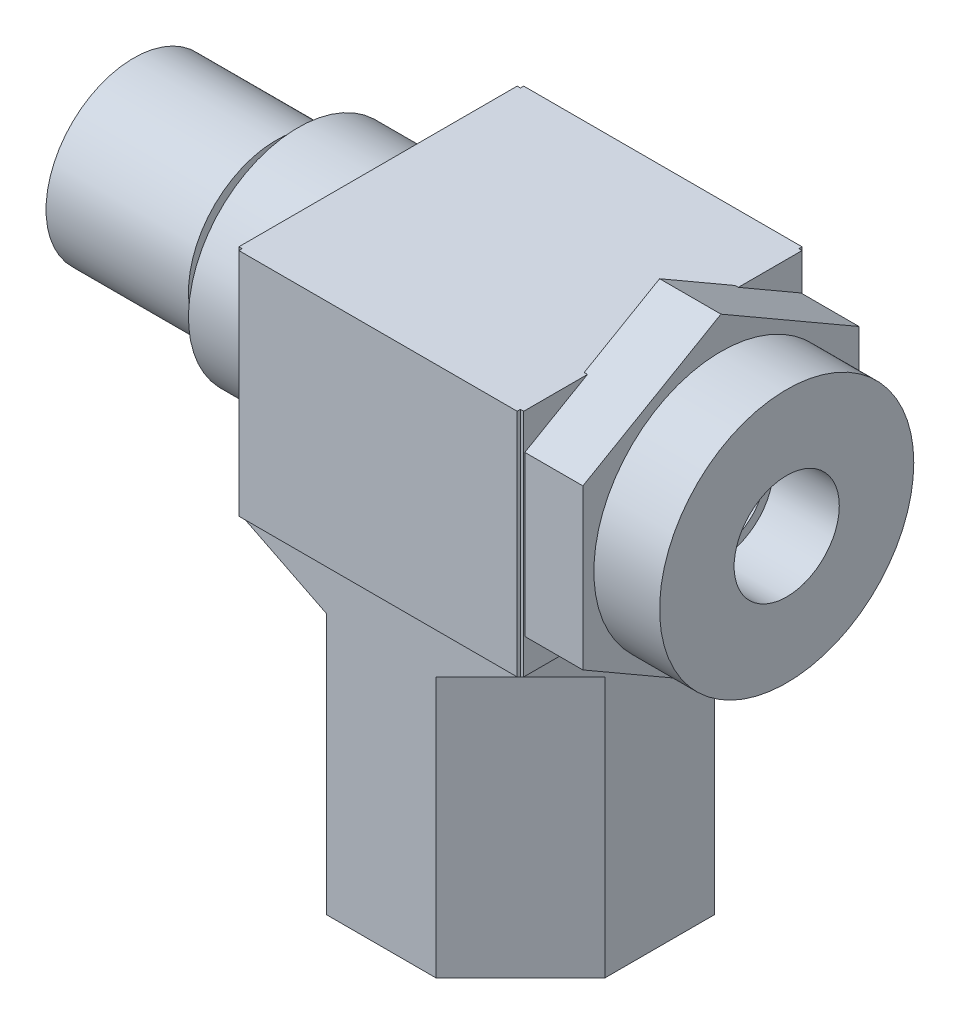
ISO-10303-21;
HEADER;
FILE_DESCRIPTION(('STEP AP214'),'2;1');
FILE_NAME('part.step','',(''),(''),'','','');
FILE_SCHEMA(('AUTOMOTIVE_DESIGN { 1 0 10303 214 1 1 1 1 }'));
ENDSEC;
DATA;
#1=APPLICATION_CONTEXT('core data for automotive mechanical design processes');
#2=APPLICATION_PROTOCOL_DEFINITION('international standard','automotive_design',2000,#1);
#3=PRODUCT_CONTEXT('',#1,'mechanical');
#4=PRODUCT('Part','Part','',(#3));
#5=PRODUCT_RELATED_PRODUCT_CATEGORY('part','',(#4));
#6=PRODUCT_DEFINITION_FORMATION('','',#4);
#7=PRODUCT_DEFINITION_CONTEXT('part definition',#1,'design');
#8=PRODUCT_DEFINITION('design','',#6,#7);
#9=PRODUCT_DEFINITION_SHAPE('','',#8);
#10=(LENGTH_UNIT() NAMED_UNIT(*) SI_UNIT(.MILLI.,.METRE.));
#11=(NAMED_UNIT(*) PLANE_ANGLE_UNIT() SI_UNIT($,.RADIAN.));
#12=(NAMED_UNIT(*) SI_UNIT($,.STERADIAN.) SOLID_ANGLE_UNIT());
#13=UNCERTAINTY_MEASURE_WITH_UNIT(LENGTH_MEASURE(1.E-05),#10,'distance_accuracy_value','');
#14=(GEOMETRIC_REPRESENTATION_CONTEXT(3) GLOBAL_UNCERTAINTY_ASSIGNED_CONTEXT((#13)) GLOBAL_UNIT_ASSIGNED_CONTEXT((#10,
#11,#12)) REPRESENTATION_CONTEXT('',''));
#15=CARTESIAN_POINT('',(0.,0.,0.));
#16=DIRECTION('',(0.,0.,1.));
#17=DIRECTION('',(1.,0.,0.));
#18=AXIS2_PLACEMENT_3D('',#15,#16,#17);
#19=CARTESIAN_POINT('',(-9.39799999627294,7.51705799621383,0.));
#20=DIRECTION('',(1.,0.,0.));
#21=DIRECTION('',(0.,0.,-1.));
#22=AXIS2_PLACEMENT_3D('',#19,#20,#21);
#23=CONICAL_SURFACE('',#22,6.34999999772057,1.03037682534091);
#24=CARTESIAN_POINT('',(-9.398,7.51705799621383,0.));
#25=DIRECTION('',(1.,0.,0.));
#26=DIRECTION('',(0.,-1.,0.));
#27=AXIS2_PLACEMENT_3D('',#24,#25,#26);
#28=CIRCLE('',#27,6.35);
#29=CARTESIAN_POINT('',(-9.398,1.16705799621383,0.));
#30=VERTEX_POINT('',#29);
#31=EDGE_CURVE('E298',#30,#30,#28,.T.);
#32=ORIENTED_EDGE('',*,*,#31,.F.);
#33=EDGE_LOOP('',(#32));
#34=FACE_BOUND('',#33,.T.);
#35=CARTESIAN_POINT('',(-10.6679999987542,7.51705799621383,0.));
#36=DIRECTION('',(1.,0.,0.));
#37=DIRECTION('',(0.,0.,-1.));
#38=AXIS2_PLACEMENT_3D('',#35,#36,#37);
#39=CIRCLE('',#38,4.23333333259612);
#40=CARTESIAN_POINT('',(-10.6679999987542,7.51705799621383,-4.23333333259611));
#41=VERTEX_POINT('',#40);
#42=EDGE_CURVE('E21',#41,#41,#39,.F.);
#43=ORIENTED_EDGE('',*,*,#42,.F.);
#44=EDGE_LOOP('',(#43));
#45=FACE_BOUND('',#44,.T.);
#46=ADVANCED_FACE('F16',(#34,#45),#23,.T.);
#47=CARTESIAN_POINT('',(11.557,7.51705799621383,0.));
#48=DIRECTION('',(1.,0.,0.));
#49=DIRECTION('',(0.,0.,-1.));
#50=AXIS2_PLACEMENT_3D('',#47,#48,#49);
#51=PLANE('',#50);
#52=DIRECTION('',(0.,-0.499999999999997,0.86602540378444));
#53=VECTOR('',#52,1.);
#54=CARTESIAN_POINT('',(11.557,16.7558170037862,0.));
#55=LINE('',#54,#53);
#56=CARTESIAN_POINT('',(11.557,16.7558170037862,0.));
#57=VERTEX_POINT('',#56);
#58=CARTESIAN_POINT('',(11.557,14.2321829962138,4.37106232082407));
#59=VERTEX_POINT('',#58);
#60=EDGE_CURVE('E291',#57,#59,#55,.T.);
#61=ORIENTED_EDGE('',*,*,#60,.F.);
#62=DIRECTION('',(0.,0.499999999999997,0.86602540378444));
#63=VECTOR('',#62,1.);
#64=CARTESIAN_POINT('',(11.557,12.1364375,-8.001));
#65=LINE('',#64,#63);
#66=CARTESIAN_POINT('',(11.557,14.2321829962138,-4.37106232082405));
#67=VERTEX_POINT('',#66);
#68=EDGE_CURVE('E275',#67,#57,#65,.T.);
#69=ORIENTED_EDGE('',*,*,#68,.F.);
#70=DIRECTION('',(0.,0.,1.));
#71=VECTOR('',#70,1.);
#72=CARTESIAN_POINT('',(11.557,14.2321829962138,-8.06449999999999));
#73=LINE('',#72,#71);
#74=EDGE_CURVE('E297',#59,#67,#73,.F.);
#75=ORIENTED_EDGE('',*,*,#74,.F.);
#76=EDGE_LOOP('',(#61,#69,#75));
#77=FACE_BOUND('',#76,.T.);
#78=ADVANCED_FACE('F296',(#77),#51,.F.);
#79=CARTESIAN_POINT('',(-10.668,7.05523981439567,0.));
#80=DIRECTION('',(1.,0.,0.));
#81=DIRECTION('',(0.,0.,-1.));
#82=AXIS2_PLACEMENT_3D('',#79,#80,#81);
#83=PLANE('',#82);
#84=ORIENTED_EDGE('',*,*,#42,.T.);
#85=EDGE_LOOP('',(#84));
#86=FACE_BOUND('',#85,.T.);
#87=CARTESIAN_POINT('',(-10.668,7.51705799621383,0.));
#88=DIRECTION('',(1.,0.,0.));
#89=DIRECTION('',(0.,0.,-1.));
#90=AXIS2_PLACEMENT_3D('',#87,#88,#89);
#91=CIRCLE('',#90,5.08);
#92=CARTESIAN_POINT('',(-10.668,7.51705799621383,-5.07999999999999));
#93=VERTEX_POINT('',#92);
#94=EDGE_CURVE('E304',#93,#93,#91,.F.);
#95=ORIENTED_EDGE('',*,*,#94,.F.);
#96=EDGE_LOOP('',(#95));
#97=FACE_BOUND('',#96,.T.);
#98=ADVANCED_FACE('F613',(#86,#97),#83,.T.);
#99=CARTESIAN_POINT('',(15.113,12.1364375,-8.001));
#100=DIRECTION('',(0.,0.86602540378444,-0.499999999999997));
#101=DIRECTION('',(0.,0.499999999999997,0.86602540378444));
#102=AXIS2_PLACEMENT_3D('',#99,#100,#101);
#103=PLANE('',#102);
#104=DIRECTION('',(0.,0.499999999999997,0.86602540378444));
#105=VECTOR('',#104,1.);
#106=CARTESIAN_POINT('',(15.113,12.1364375,-8.001));
#107=LINE('',#106,#105);
#108=CARTESIAN_POINT('',(15.113,12.1364375,-8.001));
#109=VERTEX_POINT('',#108);
#110=CARTESIAN_POINT('',(15.113,16.7558170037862,0.));
#111=VERTEX_POINT('',#110);
#112=EDGE_CURVE('E352',#109,#111,#107,.T.);
#113=ORIENTED_EDGE('',*,*,#112,.F.);
#114=DIRECTION('',(-1.,0.,0.));
#115=VECTOR('',#114,1.);
#116=CARTESIAN_POINT('',(15.113,12.1364375,-8.001));
#117=LINE('',#116,#115);
#118=CARTESIAN_POINT('',(11.7475,12.1364375,-8.001));
#119=VERTEX_POINT('',#118);
#120=EDGE_CURVE('E350',#119,#109,#117,.F.);
#121=ORIENTED_EDGE('',*,*,#120,.F.);
#122=DIRECTION('',(0.,-0.499999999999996,-0.866025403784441));
#123=VECTOR('',#122,1.);
#124=CARTESIAN_POINT('',(11.7475,14.2321829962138,-4.37106232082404));
#125=LINE('',#124,#123);
#126=CARTESIAN_POINT('',(11.7475,14.2321829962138,-4.37106232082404));
#127=VERTEX_POINT('',#126);
#128=EDGE_CURVE('E342',#127,#119,#125,.T.);
#129=ORIENTED_EDGE('',*,*,#128,.F.);
#130=DIRECTION('',(1.,0.,0.));
#131=VECTOR('',#130,1.);
#132=CARTESIAN_POINT('',(-4.76249999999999,14.2321829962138,-4.37106232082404));
#133=LINE('',#132,#131);
#134=EDGE_CURVE('E282',#67,#127,#133,.T.);
#135=ORIENTED_EDGE('',*,*,#134,.F.);
#136=ORIENTED_EDGE('',*,*,#68,.T.);
#137=DIRECTION('',(1.,0.,0.));
#138=VECTOR('',#137,1.);
#139=CARTESIAN_POINT('',(15.113,16.7558170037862,0.));
#140=LINE('',#139,#138);
#141=EDGE_CURVE('E279',#111,#57,#140,.F.);
#142=ORIENTED_EDGE('',*,*,#141,.F.);
#143=EDGE_LOOP('',(#113,#121,#129,#135,#136,#142));
#144=FACE_BOUND('',#143,.T.);
#145=ADVANCED_FACE('F278',(#144),#103,.T.);
#146=CARTESIAN_POINT('',(15.113,16.7558170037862,0.));
#147=DIRECTION('',(0.,0.86602540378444,0.499999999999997));
#148=DIRECTION('',(0.,-0.499999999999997,0.86602540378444));
#149=AXIS2_PLACEMENT_3D('',#146,#147,#148);
#150=PLANE('',#149);
#151=ORIENTED_EDGE('',*,*,#60,.T.);
#152=DIRECTION('',(1.,0.,0.));
#153=VECTOR('',#152,1.);
#154=CARTESIAN_POINT('',(-4.76249999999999,14.2321829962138,4.37106232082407));
#155=LINE('',#154,#153);
#156=CARTESIAN_POINT('',(11.7475,14.2321829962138,4.37106232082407));
#157=VERTEX_POINT('',#156);
#158=EDGE_CURVE('E305',#157,#59,#155,.F.);
#159=ORIENTED_EDGE('',*,*,#158,.F.);
#160=DIRECTION('',(0.,0.499999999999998,-0.86602540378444));
#161=VECTOR('',#160,1.);
#162=CARTESIAN_POINT('',(11.7475,12.1364375,8.001));
#163=LINE('',#162,#161);
#164=CARTESIAN_POINT('',(11.7475,12.1364375,8.001));
#165=VERTEX_POINT('',#164);
#166=EDGE_CURVE('E327',#165,#157,#163,.T.);
#167=ORIENTED_EDGE('',*,*,#166,.F.);
#168=DIRECTION('',(1.,0.,0.));
#169=VECTOR('',#168,1.);
#170=CARTESIAN_POINT('',(15.113,12.1364375,8.00099999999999));
#171=LINE('',#170,#169);
#172=CARTESIAN_POINT('',(15.113,12.1364375,8.001));
#173=VERTEX_POINT('',#172);
#174=EDGE_CURVE('E319',#173,#165,#171,.F.);
#175=ORIENTED_EDGE('',*,*,#174,.F.);
#176=DIRECTION('',(0.,-0.499999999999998,0.86602540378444));
#177=VECTOR('',#176,1.);
#178=CARTESIAN_POINT('',(15.113,16.7558170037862,0.));
#179=LINE('',#178,#177);
#180=EDGE_CURVE('E294',#111,#173,#179,.T.);
#181=ORIENTED_EDGE('',*,*,#180,.F.);
#182=ORIENTED_EDGE('',*,*,#141,.T.);
#183=EDGE_LOOP('',(#151,#159,#167,#175,#181,#182));
#184=FACE_BOUND('',#183,.T.);
#185=ADVANCED_FACE('F289',(#184),#150,.T.);
#186=CARTESIAN_POINT('',(-9.398,7.51705799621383,0.));
#187=DIRECTION('',(1.,0.,0.));
#188=DIRECTION('',(0.,0.,-1.));
#189=AXIS2_PLACEMENT_3D('',#186,#187,#188);
#190=CYLINDRICAL_SURFACE('',#189,6.35);
#191=ORIENTED_EDGE('',*,*,#31,.T.);
#192=EDGE_LOOP('',(#191));
#193=FACE_BOUND('',#192,.T.);
#194=CARTESIAN_POINT('',(-4.76249999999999,7.51705799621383,0.));
#195=DIRECTION('',(1.,0.,0.));
#196=DIRECTION('',(0.,0.,-1.));
#197=AXIS2_PLACEMENT_3D('',#194,#195,#196);
#198=CIRCLE('',#197,6.35);
#199=CARTESIAN_POINT('',(-4.76249999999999,7.51705799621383,-6.34999999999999));
#200=VERTEX_POINT('',#199);
#201=EDGE_CURVE('E387',#200,#200,#198,.T.);
#202=ORIENTED_EDGE('',*,*,#201,.F.);
#203=EDGE_LOOP('',(#202));
#204=FACE_BOUND('',#203,.T.);
#205=ADVANCED_FACE('F674',(#193,#204),#190,.T.);
#206=CARTESIAN_POINT('',(-4.76249999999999,14.2321829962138,-8.06449999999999));
#207=DIRECTION('',(0.,1.,0.));
#208=DIRECTION('',(0.,0.,1.));
#209=AXIS2_PLACEMENT_3D('',#206,#207,#208);
#210=PLANE('',#209);
#211=ORIENTED_EDGE('',*,*,#158,.T.);
#212=ORIENTED_EDGE('',*,*,#74,.T.);
#213=ORIENTED_EDGE('',*,*,#134,.T.);
#214=DIRECTION('',(0.,0.,-1.));
#215=VECTOR('',#214,1.);
#216=CARTESIAN_POINT('',(11.7475,14.2321829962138,-8.06449999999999));
#217=LINE('',#216,#215);
#218=CARTESIAN_POINT('',(11.7475,14.2321829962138,-8.06449999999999));
#219=VERTEX_POINT('',#218);
#220=EDGE_CURVE('E345',#219,#127,#217,.F.);
#221=ORIENTED_EDGE('',*,*,#220,.F.);
#222=DIRECTION('',(1.,0.,0.));
#223=VECTOR('',#222,1.);
#224=CARTESIAN_POINT('',(3.49250000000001,14.2321829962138,-8.06449999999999));
#225=LINE('',#224,#223);
#226=CARTESIAN_POINT('',(11.557,14.2321829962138,-8.06449999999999));
#227=VERTEX_POINT('',#226);
#228=EDGE_CURVE('E333',#219,#227,#225,.F.);
#229=ORIENTED_EDGE('',*,*,#228,.T.);
#230=DIRECTION('',(0.,0.,-1.));
#231=VECTOR('',#230,1.);
#232=CARTESIAN_POINT('',(11.557,14.2321829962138,0.));
#233=LINE('',#232,#231);
#234=CARTESIAN_POINT('',(11.557,14.2321829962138,-8.25499999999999));
#235=VERTEX_POINT('',#234);
#236=EDGE_CURVE('E317',#235,#227,#233,.F.);
#237=ORIENTED_EDGE('',*,*,#236,.F.);
#238=DIRECTION('',(-1.,0.,0.));
#239=VECTOR('',#238,1.);
#240=CARTESIAN_POINT('',(-4.57200000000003,14.2321829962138,-8.25499999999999));
#241=LINE('',#240,#239);
#242=CARTESIAN_POINT('',(-4.57200000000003,14.2321829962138,-8.25499999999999));
#243=VERTEX_POINT('',#242);
#244=EDGE_CURVE('E312',#243,#235,#241,.F.);
#245=ORIENTED_EDGE('',*,*,#244,.F.);
#246=DIRECTION('',(0.,0.,-1.));
#247=VECTOR('',#246,1.);
#248=CARTESIAN_POINT('',(-4.57200000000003,14.2321829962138,0.));
#249=LINE('',#248,#247);
#250=CARTESIAN_POINT('',(-4.57200000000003,14.2321829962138,-8.0645));
#251=VERTEX_POINT('',#250);
#252=EDGE_CURVE('E308',#243,#251,#249,.F.);
#253=ORIENTED_EDGE('',*,*,#252,.T.);
#254=DIRECTION('',(1.,0.,0.));
#255=VECTOR('',#254,1.);
#256=CARTESIAN_POINT('',(3.49250000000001,14.2321829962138,-8.06449999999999));
#257=LINE('',#256,#255);
#258=CARTESIAN_POINT('',(-4.76249999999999,14.2321829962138,-8.0645));
#259=VERTEX_POINT('',#258);
#260=EDGE_CURVE('E395',#251,#259,#257,.F.);
#261=ORIENTED_EDGE('',*,*,#260,.T.);
#262=DIRECTION('',(0.,0.,1.));
#263=VECTOR('',#262,1.);
#264=CARTESIAN_POINT('',(-4.76249999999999,14.2321829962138,-8.06449999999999));
#265=LINE('',#264,#263);
#266=CARTESIAN_POINT('',(-4.76249999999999,14.2321829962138,8.06450000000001));
#267=VERTEX_POINT('',#266);
#268=EDGE_CURVE('E385',#267,#259,#265,.F.);
#269=ORIENTED_EDGE('',*,*,#268,.F.);
#270=DIRECTION('',(1.,0.,0.));
#271=VECTOR('',#270,1.);
#272=CARTESIAN_POINT('',(3.49250000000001,14.2321829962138,8.06450000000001));
#273=LINE('',#272,#271);
#274=CARTESIAN_POINT('',(-4.57200000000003,14.2321829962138,8.06450000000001));
#275=VERTEX_POINT('',#274);
#276=EDGE_CURVE('E380',#275,#267,#273,.F.);
#277=ORIENTED_EDGE('',*,*,#276,.F.);
#278=DIRECTION('',(0.,0.,-1.));
#279=VECTOR('',#278,1.);
#280=CARTESIAN_POINT('',(-4.57200000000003,14.2321829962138,0.));
#281=LINE('',#280,#279);
#282=CARTESIAN_POINT('',(-4.57200000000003,14.2321829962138,8.25499999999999));
#283=VERTEX_POINT('',#282);
#284=EDGE_CURVE('E371',#275,#283,#281,.F.);
#285=ORIENTED_EDGE('',*,*,#284,.T.);
#286=DIRECTION('',(1.,0.,0.));
#287=VECTOR('',#286,1.);
#288=CARTESIAN_POINT('',(-4.57200000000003,14.2321829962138,8.25499999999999));
#289=LINE('',#288,#287);
#290=CARTESIAN_POINT('',(11.557,14.2321829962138,8.25499999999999));
#291=VERTEX_POINT('',#290);
#292=EDGE_CURVE('E369',#291,#283,#289,.F.);
#293=ORIENTED_EDGE('',*,*,#292,.F.);
#294=DIRECTION('',(0.,0.,-1.));
#295=VECTOR('',#294,1.);
#296=CARTESIAN_POINT('',(11.557,14.2321829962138,0.));
#297=LINE('',#296,#295);
#298=CARTESIAN_POINT('',(11.557,14.2321829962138,8.06450000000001));
#299=VERTEX_POINT('',#298);
#300=EDGE_CURVE('E363',#299,#291,#297,.F.);
#301=ORIENTED_EDGE('',*,*,#300,.F.);
#302=DIRECTION('',(1.,0.,0.));
#303=VECTOR('',#302,1.);
#304=CARTESIAN_POINT('',(3.49250000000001,14.2321829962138,8.06450000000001));
#305=LINE('',#304,#303);
#306=CARTESIAN_POINT('',(11.7475,14.2321829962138,8.06450000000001));
#307=VERTEX_POINT('',#306);
#308=EDGE_CURVE('E331',#307,#299,#305,.F.);
#309=ORIENTED_EDGE('',*,*,#308,.F.);
#310=DIRECTION('',(0.,0.,-1.));
#311=VECTOR('',#310,1.);
#312=CARTESIAN_POINT('',(11.7475,14.2321829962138,-8.06449999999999));
#313=LINE('',#312,#311);
#314=EDGE_CURVE('E324',#157,#307,#313,.F.);
#315=ORIENTED_EDGE('',*,*,#314,.F.);
#316=EDGE_LOOP('',(#211,#212,#213,#221,#229,#237,#245,#253,#261,#269,#277,#285,#293,#301,#309,#315));
#317=FACE_BOUND('',#316,.T.);
#318=ADVANCED_FACE('F664',(#317),#210,.T.);
#319=CARTESIAN_POINT('',(15.113,7.51705799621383,0.));
#320=DIRECTION('',(1.,0.,0.));
#321=DIRECTION('',(0.,0.,-1.));
#322=AXIS2_PLACEMENT_3D('',#319,#320,#321);
#323=CYLINDRICAL_SURFACE('',#322,7.366);
#324=CARTESIAN_POINT('',(15.113,7.51705799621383,0.));
#325=DIRECTION('',(1.,0.,0.));
#326=DIRECTION('',(0.,0.,-1.));
#327=AXIS2_PLACEMENT_3D('',#324,#325,#326);
#328=CIRCLE('',#327,7.366);
#329=CARTESIAN_POINT('',(15.113,7.51705799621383,-7.36599999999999));
#330=VERTEX_POINT('',#329);
#331=EDGE_CURVE('E358',#330,#330,#328,.F.);
#332=ORIENTED_EDGE('',*,*,#331,.F.);
#333=EDGE_LOOP('',(#332));
#334=FACE_BOUND('',#333,.T.);
#335=CARTESIAN_POINT('',(18.923,7.51705799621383,0.));
#336=DIRECTION('',(1.,0.,0.));
#337=DIRECTION('',(0.,0.,-1.));
#338=AXIS2_PLACEMENT_3D('',#335,#336,#337);
#339=CIRCLE('',#338,7.366);
#340=CARTESIAN_POINT('',(18.923,7.51705799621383,-7.36599999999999));
#341=VERTEX_POINT('',#340);
#342=EDGE_CURVE('E391',#341,#341,#339,.T.);
#343=ORIENTED_EDGE('',*,*,#342,.F.);
#344=EDGE_LOOP('',(#343));
#345=FACE_BOUND('',#344,.T.);
#346=ADVANCED_FACE('F662',(#334,#345),#323,.T.);
#347=CARTESIAN_POINT('',(-18.923,7.51705799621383,0.));
#348=DIRECTION('',(1.,0.,0.));
#349=DIRECTION('',(0.,0.,-1.));
#350=AXIS2_PLACEMENT_3D('',#347,#348,#349);
#351=CYLINDRICAL_SURFACE('',#350,5.08);
#352=CARTESIAN_POINT('',(-18.923,7.51705799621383,0.));
#353=DIRECTION('',(1.,0.,0.));
#354=DIRECTION('',(0.,0.,-1.));
#355=AXIS2_PLACEMENT_3D('',#352,#353,#354);
#356=CIRCLE('',#355,5.08);
#357=CARTESIAN_POINT('',(-18.923,7.51705799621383,-5.07999999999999));
#358=VERTEX_POINT('',#357);
#359=EDGE_CURVE('E401',#358,#358,#356,.T.);
#360=ORIENTED_EDGE('',*,*,#359,.T.);
#361=EDGE_LOOP('',(#360));
#362=FACE_BOUND('',#361,.T.);
#363=ORIENTED_EDGE('',*,*,#94,.T.);
#364=EDGE_LOOP('',(#363));
#365=FACE_BOUND('',#364,.T.);
#366=ADVANCED_FACE('F611',(#362,#365),#351,.T.);
#367=CARTESIAN_POINT('',(-4.57200000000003,0.527140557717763,0.));
#368=DIRECTION('',(1.,0.,0.));
#369=DIRECTION('',(0.,0.,-1.));
#370=AXIS2_PLACEMENT_3D('',#367,#368,#369);
#371=PLANE('',#370);
#372=ORIENTED_EDGE('',*,*,#252,.F.);
#373=DIRECTION('',(0.,1.,0.));
#374=VECTOR('',#373,1.);
#375=CARTESIAN_POINT('',(-4.57200000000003,13.0891829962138,-8.25499999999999));
#376=LINE('',#375,#374);
#377=CARTESIAN_POINT('',(-4.57200000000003,0.89718299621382,-8.25499999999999));
#378=VERTEX_POINT('',#377);
#379=EDGE_CURVE('E311',#378,#243,#376,.T.);
#380=ORIENTED_EDGE('',*,*,#379,.F.);
#381=DIRECTION('',(0.,0.447213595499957,-0.894427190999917));
#382=VECTOR('',#381,1.);
#383=CARTESIAN_POINT('',(-4.57200000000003,0.89718299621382,-8.25499999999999));
#384=LINE('',#383,#382);
#385=CARTESIAN_POINT('',(-4.57200000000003,0.801932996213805,-8.0645));
#386=VERTEX_POINT('',#385);
#387=EDGE_CURVE('E400',#386,#378,#384,.T.);
#388=ORIENTED_EDGE('',*,*,#387,.F.);
#389=DIRECTION('',(0.,1.,0.));
#390=VECTOR('',#389,1.);
#391=CARTESIAN_POINT('',(-4.57200000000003,0.527140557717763,-8.06449999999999));
#392=LINE('',#391,#390);
#393=EDGE_CURVE('E93',#386,#251,#392,.T.);
#394=ORIENTED_EDGE('',*,*,#393,.T.);
#395=EDGE_LOOP('',(#372,#380,#388,#394));
#396=FACE_BOUND('',#395,.T.);
#397=ADVANCED_FACE('F671',(#396),#371,.F.);
#398=CARTESIAN_POINT('',(-4.57200000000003,13.0891829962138,-8.25499999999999));
#399=DIRECTION('',(0.,0.,-1.));
#400=DIRECTION('',(-1.,0.,0.));
#401=AXIS2_PLACEMENT_3D('',#398,#399,#400);
#402=PLANE('',#401);
#403=ORIENTED_EDGE('',*,*,#379,.T.);
#404=ORIENTED_EDGE('',*,*,#244,.T.);
#405=DIRECTION('',(0.,1.,0.));
#406=VECTOR('',#405,1.);
#407=CARTESIAN_POINT('',(11.557,0.527140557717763,-8.25499999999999));
#408=LINE('',#407,#406);
#409=CARTESIAN_POINT('',(11.557,0.89718299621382,-8.25499999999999));
#410=VERTEX_POINT('',#409);
#411=EDGE_CURVE('E314',#410,#235,#408,.T.);
#412=ORIENTED_EDGE('',*,*,#411,.F.);
#413=DIRECTION('',(1.,0.,0.));
#414=VECTOR('',#413,1.);
#415=CARTESIAN_POINT('',(-4.57200000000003,0.89718299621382,-8.25499999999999));
#416=LINE('',#415,#414);
#417=EDGE_CURVE('E405',#378,#410,#416,.T.);
#418=ORIENTED_EDGE('',*,*,#417,.F.);
#419=EDGE_LOOP('',(#403,#404,#412,#418));
#420=FACE_BOUND('',#419,.T.);
#421=ADVANCED_FACE('F682',(#420),#402,.T.);
#422=CARTESIAN_POINT('',(11.557,0.527140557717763,0.));
#423=DIRECTION('',(1.,0.,0.));
#424=DIRECTION('',(0.,0.,-1.));
#425=AXIS2_PLACEMENT_3D('',#422,#423,#424);
#426=PLANE('',#425);
#427=ORIENTED_EDGE('',*,*,#411,.T.);
#428=ORIENTED_EDGE('',*,*,#236,.T.);
#429=DIRECTION('',(0.,1.,0.));
#430=VECTOR('',#429,1.);
#431=CARTESIAN_POINT('',(11.557,0.527140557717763,-8.06449999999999));
#432=LINE('',#431,#430);
#433=CARTESIAN_POINT('',(11.557,0.801932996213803,-8.06449999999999));
#434=VERTEX_POINT('',#433);
#435=EDGE_CURVE('E336',#227,#434,#432,.F.);
#436=ORIENTED_EDGE('',*,*,#435,.T.);
#437=DIRECTION('',(0.,0.447213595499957,-0.894427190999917));
#438=VECTOR('',#437,1.);
#439=CARTESIAN_POINT('',(11.557,0.89718299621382,-8.25499999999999));
#440=LINE('',#439,#438);
#441=EDGE_CURVE('E402',#410,#434,#440,.F.);
#442=ORIENTED_EDGE('',*,*,#441,.F.);
#443=EDGE_LOOP('',(#427,#428,#436,#442));
#444=FACE_BOUND('',#443,.T.);
#445=ADVANCED_FACE('F686',(#444),#426,.T.);
#446=CARTESIAN_POINT('',(15.113,12.1364375,8.00099999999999));
#447=DIRECTION('',(0.,0.,1.));
#448=DIRECTION('',(1.,0.,0.));
#449=AXIS2_PLACEMENT_3D('',#446,#447,#448);
#450=PLANE('',#449);
#451=DIRECTION('',(0.,1.,0.));
#452=VECTOR('',#451,1.);
#453=CARTESIAN_POINT('',(15.113,7.51705799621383,8.00099999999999));
#454=LINE('',#453,#452);
#455=CARTESIAN_POINT('',(15.113,2.89767849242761,8.001));
#456=VERTEX_POINT('',#455);
#457=EDGE_CURVE('E359',#173,#456,#454,.F.);
#458=ORIENTED_EDGE('',*,*,#457,.F.);
#459=ORIENTED_EDGE('',*,*,#174,.T.);
#460=DIRECTION('',(0.,1.,0.));
#461=VECTOR('',#460,1.);
#462=CARTESIAN_POINT('',(11.7475,13.0891829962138,8.00100000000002));
#463=LINE('',#462,#461);
#464=CARTESIAN_POINT('',(11.7475,2.89767849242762,8.00100000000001));
#465=VERTEX_POINT('',#464);
#466=EDGE_CURVE('E323',#465,#165,#463,.T.);
#467=ORIENTED_EDGE('',*,*,#466,.F.);
#468=DIRECTION('',(1.,0.,0.));
#469=VECTOR('',#468,1.);
#470=CARTESIAN_POINT('',(15.113,2.89767849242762,8.00100000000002));
#471=LINE('',#470,#469);
#472=EDGE_CURVE('E411',#456,#465,#471,.F.);
#473=ORIENTED_EDGE('',*,*,#472,.F.);
#474=EDGE_LOOP('',(#458,#459,#467,#473));
#475=FACE_BOUND('',#474,.T.);
#476=ADVANCED_FACE('F690',(#475),#450,.T.);
#477=CARTESIAN_POINT('',(11.7475,13.0891829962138,-8.06449999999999));
#478=DIRECTION('',(1.,0.,0.));
#479=DIRECTION('',(0.,0.,-1.));
#480=AXIS2_PLACEMENT_3D('',#477,#478,#479);
#481=PLANE('',#480);
#482=DIRECTION('',(0.,1.,0.));
#483=VECTOR('',#482,1.);
#484=CARTESIAN_POINT('',(11.7475,0.527140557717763,8.06450000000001));
#485=LINE('',#484,#483);
#486=CARTESIAN_POINT('',(11.7475,0.89718299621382,8.06450000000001));
#487=VERTEX_POINT('',#486);
#488=EDGE_CURVE('E326',#487,#307,#485,.T.);
#489=ORIENTED_EDGE('',*,*,#488,.F.);
#490=DIRECTION('',(0.,0.,1.));
#491=VECTOR('',#490,1.);
#492=CARTESIAN_POINT('',(11.7475,0.89718299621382,-8.06449999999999));
#493=LINE('',#492,#491);
#494=CARTESIAN_POINT('',(11.7475,0.89718299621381,4.53604016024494));
#495=VERTEX_POINT('',#494);
#496=EDGE_CURVE('E422',#495,#487,#493,.T.);
#497=ORIENTED_EDGE('',*,*,#496,.F.);
#498=DIRECTION('',(0.,-0.499999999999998,-0.86602540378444));
#499=VECTOR('',#498,1.);
#500=CARTESIAN_POINT('',(11.7475,2.89767849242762,8.00100000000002));
#501=LINE('',#500,#499);
#502=EDGE_CURVE('E410',#465,#495,#501,.T.);
#503=ORIENTED_EDGE('',*,*,#502,.F.);
#504=ORIENTED_EDGE('',*,*,#466,.T.);
#505=ORIENTED_EDGE('',*,*,#166,.T.);
#506=ORIENTED_EDGE('',*,*,#314,.T.);
#507=EDGE_LOOP('',(#489,#497,#503,#504,#505,#506));
#508=FACE_BOUND('',#507,.T.);
#509=ADVANCED_FACE('F694',(#508),#481,.T.);
#510=CARTESIAN_POINT('',(3.49250000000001,0.527140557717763,8.06450000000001));
#511=DIRECTION('',(0.,0.,1.));
#512=DIRECTION('',(1.,0.,0.));
#513=AXIS2_PLACEMENT_3D('',#510,#511,#512);
#514=PLANE('',#513);
#515=ORIENTED_EDGE('',*,*,#488,.T.);
#516=ORIENTED_EDGE('',*,*,#308,.T.);
#517=DIRECTION('',(0.,1.,0.));
#518=VECTOR('',#517,1.);
#519=CARTESIAN_POINT('',(11.557,0.527140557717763,8.06450000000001));
#520=LINE('',#519,#518);
#521=CARTESIAN_POINT('',(11.557,0.801932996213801,8.06450000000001));
#522=VERTEX_POINT('',#521);
#523=EDGE_CURVE('E366',#522,#299,#520,.T.);
#524=ORIENTED_EDGE('',*,*,#523,.F.);
#525=DIRECTION('',(0.894427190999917,0.447213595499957,0.));
#526=VECTOR('',#525,1.);
#527=CARTESIAN_POINT('',(11.7475,0.89718299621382,8.06450000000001));
#528=LINE('',#527,#526);
#529=EDGE_CURVE('E419',#487,#522,#528,.F.);
#530=ORIENTED_EDGE('',*,*,#529,.F.);
#531=EDGE_LOOP('',(#515,#516,#524,#530));
#532=FACE_BOUND('',#531,.T.);
#533=ADVANCED_FACE('F698',(#532),#514,.T.);
#534=CARTESIAN_POINT('',(3.49250000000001,0.527140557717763,-8.06449999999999));
#535=DIRECTION('',(0.,0.,1.));
#536=DIRECTION('',(1.,0.,0.));
#537=AXIS2_PLACEMENT_3D('',#534,#535,#536);
#538=PLANE('',#537);
#539=ORIENTED_EDGE('',*,*,#228,.F.);
#540=DIRECTION('',(0.,1.,0.));
#541=VECTOR('',#540,1.);
#542=CARTESIAN_POINT('',(11.7475,13.0891829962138,-8.06449999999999));
#543=LINE('',#542,#541);
#544=CARTESIAN_POINT('',(11.7475,0.89718299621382,-8.06449999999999));
#545=VERTEX_POINT('',#544);
#546=EDGE_CURVE('E339',#545,#219,#543,.T.);
#547=ORIENTED_EDGE('',*,*,#546,.F.);
#548=DIRECTION('',(0.894427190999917,0.447213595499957,0.));
#549=VECTOR('',#548,1.);
#550=CARTESIAN_POINT('',(11.7475,0.89718299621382,-8.06449999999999));
#551=LINE('',#550,#549);
#552=EDGE_CURVE('E429',#434,#545,#551,.T.);
#553=ORIENTED_EDGE('',*,*,#552,.F.);
#554=ORIENTED_EDGE('',*,*,#435,.F.);
#555=EDGE_LOOP('',(#539,#547,#553,#554));
#556=FACE_BOUND('',#555,.T.);
#557=ADVANCED_FACE('F702',(#556),#538,.F.);
#558=CARTESIAN_POINT('',(11.7475,13.0891829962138,-8.06449999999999));
#559=DIRECTION('',(1.,0.,0.));
#560=DIRECTION('',(0.,0.,-1.));
#561=AXIS2_PLACEMENT_3D('',#558,#559,#560);
#562=PLANE('',#561);
#563=ORIENTED_EDGE('',*,*,#128,.T.);
#564=DIRECTION('',(0.,1.,0.));
#565=VECTOR('',#564,1.);
#566=CARTESIAN_POINT('',(11.7475,2.89767849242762,-8.001));
#567=LINE('',#566,#565);
#568=CARTESIAN_POINT('',(11.7475,2.89767849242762,-8.001));
#569=VERTEX_POINT('',#568);
#570=EDGE_CURVE('E344',#569,#119,#567,.T.);
#571=ORIENTED_EDGE('',*,*,#570,.F.);
#572=DIRECTION('',(0.,0.499999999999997,-0.86602540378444));
#573=VECTOR('',#572,1.);
#574=CARTESIAN_POINT('',(11.7475,-1.72170101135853,0.));
#575=LINE('',#574,#573);
#576=CARTESIAN_POINT('',(11.7475,0.897182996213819,-4.53604016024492));
#577=VERTEX_POINT('',#576);
#578=EDGE_CURVE('E434',#577,#569,#575,.T.);
#579=ORIENTED_EDGE('',*,*,#578,.F.);
#580=DIRECTION('',(0.,0.,1.));
#581=VECTOR('',#580,1.);
#582=CARTESIAN_POINT('',(11.7475,0.89718299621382,-8.06449999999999));
#583=LINE('',#582,#581);
#584=EDGE_CURVE('E432',#545,#577,#583,.T.);
#585=ORIENTED_EDGE('',*,*,#584,.F.);
#586=ORIENTED_EDGE('',*,*,#546,.T.);
#587=ORIENTED_EDGE('',*,*,#220,.T.);
#588=EDGE_LOOP('',(#563,#571,#579,#585,#586,#587));
#589=FACE_BOUND('',#588,.T.);
#590=ADVANCED_FACE('F706',(#589),#562,.T.);
#591=CARTESIAN_POINT('',(15.113,2.89767849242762,-8.001));
#592=DIRECTION('',(0.,0.,-1.));
#593=DIRECTION('',(-1.,0.,0.));
#594=AXIS2_PLACEMENT_3D('',#591,#592,#593);
#595=PLANE('',#594);
#596=DIRECTION('',(0.,1.,0.));
#597=VECTOR('',#596,1.);
#598=CARTESIAN_POINT('',(15.113,7.51705799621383,-8.001));
#599=LINE('',#598,#597);
#600=CARTESIAN_POINT('',(15.113,2.89767849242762,-8.001));
#601=VERTEX_POINT('',#600);
#602=EDGE_CURVE('E355',#601,#109,#599,.T.);
#603=ORIENTED_EDGE('',*,*,#602,.F.);
#604=DIRECTION('',(1.,0.,0.));
#605=VECTOR('',#604,1.);
#606=CARTESIAN_POINT('',(15.113,2.89767849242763,-8.00099999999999));
#607=LINE('',#606,#605);
#608=EDGE_CURVE('E444',#569,#601,#607,.T.);
#609=ORIENTED_EDGE('',*,*,#608,.F.);
#610=ORIENTED_EDGE('',*,*,#570,.T.);
#611=ORIENTED_EDGE('',*,*,#120,.T.);
#612=EDGE_LOOP('',(#603,#609,#610,#611));
#613=FACE_BOUND('',#612,.T.);
#614=ADVANCED_FACE('F710',(#613),#595,.T.);
#615=CARTESIAN_POINT('',(15.113,7.51705799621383,0.));
#616=DIRECTION('',(1.,0.,0.));
#617=DIRECTION('',(0.,0.,-1.));
#618=AXIS2_PLACEMENT_3D('',#615,#616,#617);
#619=PLANE('',#618);
#620=ORIENTED_EDGE('',*,*,#331,.T.);
#621=EDGE_LOOP('',(#620));
#622=FACE_BOUND('',#621,.T.);
#623=DIRECTION('',(0.,0.499999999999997,-0.86602540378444));
#624=VECTOR('',#623,1.);
#625=CARTESIAN_POINT('',(15.113,-1.72170101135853,0.));
#626=LINE('',#625,#624);
#627=CARTESIAN_POINT('',(15.113,-1.72170101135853,0.));
#628=VERTEX_POINT('',#627);
#629=EDGE_CURVE('E442',#601,#628,#626,.F.);
#630=ORIENTED_EDGE('',*,*,#629,.F.);
#631=ORIENTED_EDGE('',*,*,#602,.T.);
#632=ORIENTED_EDGE('',*,*,#112,.T.);
#633=ORIENTED_EDGE('',*,*,#180,.T.);
#634=ORIENTED_EDGE('',*,*,#457,.T.);
#635=DIRECTION('',(0.,-0.499999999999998,-0.86602540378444));
#636=VECTOR('',#635,1.);
#637=CARTESIAN_POINT('',(15.113,2.89767849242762,8.00100000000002));
#638=LINE('',#637,#636);
#639=EDGE_CURVE('E415',#628,#456,#638,.F.);
#640=ORIENTED_EDGE('',*,*,#639,.F.);
#641=EDGE_LOOP('',(#630,#631,#632,#633,#634,#640));
#642=FACE_BOUND('',#641,.T.);
#643=ADVANCED_FACE('F714',(#622,#642),#619,.T.);
#644=CARTESIAN_POINT('',(11.557,0.527140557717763,0.));
#645=DIRECTION('',(1.,0.,0.));
#646=DIRECTION('',(0.,0.,-1.));
#647=AXIS2_PLACEMENT_3D('',#644,#645,#646);
#648=PLANE('',#647);
#649=DIRECTION('',(0.,1.,0.));
#650=VECTOR('',#649,1.);
#651=CARTESIAN_POINT('',(11.557,13.0891829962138,8.25499999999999));
#652=LINE('',#651,#650);
#653=CARTESIAN_POINT('',(11.557,0.897182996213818,8.25499999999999));
#654=VERTEX_POINT('',#653);
#655=EDGE_CURVE('E365',#654,#291,#652,.T.);
#656=ORIENTED_EDGE('',*,*,#655,.F.);
#657=DIRECTION('',(0.,-0.447213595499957,-0.894427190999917));
#658=VECTOR('',#657,1.);
#659=CARTESIAN_POINT('',(11.557,-1.64281700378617,3.17500000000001));
#660=LINE('',#659,#658);
#661=EDGE_CURVE('E449',#522,#654,#660,.F.);
#662=ORIENTED_EDGE('',*,*,#661,.F.);
#663=ORIENTED_EDGE('',*,*,#523,.T.);
#664=ORIENTED_EDGE('',*,*,#300,.T.);
#665=EDGE_LOOP('',(#656,#662,#663,#664));
#666=FACE_BOUND('',#665,.T.);
#667=ADVANCED_FACE('F718',(#666),#648,.T.);
#668=CARTESIAN_POINT('',(-4.57200000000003,13.0891829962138,8.25499999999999));
#669=DIRECTION('',(0.,0.,1.));
#670=DIRECTION('',(1.,0.,0.));
#671=AXIS2_PLACEMENT_3D('',#668,#669,#670);
#672=PLANE('',#671);
#673=DIRECTION('',(0.,1.,0.));
#674=VECTOR('',#673,1.);
#675=CARTESIAN_POINT('',(-4.57200000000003,0.527140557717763,8.25499999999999));
#676=LINE('',#675,#674);
#677=CARTESIAN_POINT('',(-4.57200000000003,0.897182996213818,8.25499999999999));
#678=VERTEX_POINT('',#677);
#679=EDGE_CURVE('E374',#283,#678,#676,.F.);
#680=ORIENTED_EDGE('',*,*,#679,.T.);
#681=DIRECTION('',(1.,0.,0.));
#682=VECTOR('',#681,1.);
#683=CARTESIAN_POINT('',(-4.57200000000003,0.897182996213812,8.25499999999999));
#684=LINE('',#683,#682);
#685=EDGE_CURVE('E452',#654,#678,#684,.F.);
#686=ORIENTED_EDGE('',*,*,#685,.F.);
#687=ORIENTED_EDGE('',*,*,#655,.T.);
#688=ORIENTED_EDGE('',*,*,#292,.T.);
#689=EDGE_LOOP('',(#680,#686,#687,#688));
#690=FACE_BOUND('',#689,.T.);
#691=ADVANCED_FACE('F722',(#690),#672,.T.);
#692=CARTESIAN_POINT('',(-4.57200000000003,0.527140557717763,0.));
#693=DIRECTION('',(1.,0.,0.));
#694=DIRECTION('',(0.,0.,-1.));
#695=AXIS2_PLACEMENT_3D('',#692,#693,#694);
#696=PLANE('',#695);
#697=DIRECTION('',(0.,-0.447213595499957,-0.894427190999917));
#698=VECTOR('',#697,1.);
#699=CARTESIAN_POINT('',(-4.57200000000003,-1.64281700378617,3.17500000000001));
#700=LINE('',#699,#698);
#701=CARTESIAN_POINT('',(-4.57200000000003,0.801932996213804,8.0645));
#702=VERTEX_POINT('',#701);
#703=EDGE_CURVE('E106',#678,#702,#700,.T.);
#704=ORIENTED_EDGE('',*,*,#703,.F.);
#705=ORIENTED_EDGE('',*,*,#679,.F.);
#706=ORIENTED_EDGE('',*,*,#284,.F.);
#707=DIRECTION('',(0.,1.,0.));
#708=VECTOR('',#707,1.);
#709=CARTESIAN_POINT('',(-4.57200000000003,0.527140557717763,8.06450000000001));
#710=LINE('',#709,#708);
#711=EDGE_CURVE('E377',#702,#275,#710,.T.);
#712=ORIENTED_EDGE('',*,*,#711,.F.);
#713=EDGE_LOOP('',(#704,#705,#706,#712));
#714=FACE_BOUND('',#713,.T.);
#715=ADVANCED_FACE('F726',(#714),#696,.F.);
#716=CARTESIAN_POINT('',(3.49250000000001,0.527140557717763,8.06450000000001));
#717=DIRECTION('',(0.,0.,1.));
#718=DIRECTION('',(1.,0.,0.));
#719=AXIS2_PLACEMENT_3D('',#716,#717,#718);
#720=PLANE('',#719);
#721=DIRECTION('',(0.,1.,0.));
#722=VECTOR('',#721,1.);
#723=CARTESIAN_POINT('',(-4.76249999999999,13.0891829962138,8.0645));
#724=LINE('',#723,#722);
#725=CARTESIAN_POINT('',(-4.76249999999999,0.897182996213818,8.06450000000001));
#726=VERTEX_POINT('',#725);
#727=EDGE_CURVE('E382',#726,#267,#724,.T.);
#728=ORIENTED_EDGE('',*,*,#727,.F.);
#729=DIRECTION('',(0.894427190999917,-0.447213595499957,0.));
#730=VECTOR('',#729,1.);
#731=CARTESIAN_POINT('',(0.317499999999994,-1.64281700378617,8.06450000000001));
#732=LINE('',#731,#730);
#733=EDGE_CURVE('E470',#702,#726,#732,.F.);
#734=ORIENTED_EDGE('',*,*,#733,.F.);
#735=ORIENTED_EDGE('',*,*,#711,.T.);
#736=ORIENTED_EDGE('',*,*,#276,.T.);
#737=EDGE_LOOP('',(#728,#734,#735,#736));
#738=FACE_BOUND('',#737,.T.);
#739=ADVANCED_FACE('F730',(#738),#720,.T.);
#740=CARTESIAN_POINT('',(-4.76249999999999,13.0891829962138,-8.06449999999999));
#741=DIRECTION('',(-1.,0.,0.));
#742=DIRECTION('',(0.,0.,1.));
#743=AXIS2_PLACEMENT_3D('',#740,#741,#742);
#744=PLANE('',#743);
#745=ORIENTED_EDGE('',*,*,#201,.T.);
#746=EDGE_LOOP('',(#745));
#747=FACE_BOUND('',#746,.T.);
#748=DIRECTION('',(0.,1.,0.));
#749=VECTOR('',#748,1.);
#750=CARTESIAN_POINT('',(-4.76249999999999,0.527140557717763,-8.06449999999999));
#751=LINE('',#750,#749);
#752=CARTESIAN_POINT('',(-4.76249999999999,0.897182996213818,-8.06449999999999));
#753=VERTEX_POINT('',#752);
#754=EDGE_CURVE('E392',#259,#753,#751,.F.);
#755=ORIENTED_EDGE('',*,*,#754,.T.);
#756=DIRECTION('',(0.,0.,1.));
#757=VECTOR('',#756,1.);
#758=CARTESIAN_POINT('',(-4.76249999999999,0.897182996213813,-8.06449999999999));
#759=LINE('',#758,#757);
#760=EDGE_CURVE('E477',#726,#753,#759,.F.);
#761=ORIENTED_EDGE('',*,*,#760,.F.);
#762=ORIENTED_EDGE('',*,*,#727,.T.);
#763=ORIENTED_EDGE('',*,*,#268,.T.);
#764=EDGE_LOOP('',(#755,#761,#762,#763));
#765=FACE_BOUND('',#764,.T.);
#766=ADVANCED_FACE('F734',(#747,#765),#744,.T.);
#767=CARTESIAN_POINT('',(3.49250000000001,0.527140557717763,-8.06449999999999));
#768=DIRECTION('',(0.,0.,1.));
#769=DIRECTION('',(1.,0.,0.));
#770=AXIS2_PLACEMENT_3D('',#767,#768,#769);
#771=PLANE('',#770);
#772=DIRECTION('',(0.894427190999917,-0.447213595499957,0.));
#773=VECTOR('',#772,1.);
#774=CARTESIAN_POINT('',(0.317499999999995,-1.64281700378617,-8.06449999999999));
#775=LINE('',#774,#773);
#776=EDGE_CURVE('E473',#753,#386,#775,.T.);
#777=ORIENTED_EDGE('',*,*,#776,.F.);
#778=ORIENTED_EDGE('',*,*,#754,.F.);
#779=ORIENTED_EDGE('',*,*,#260,.F.);
#780=ORIENTED_EDGE('',*,*,#393,.F.);
#781=EDGE_LOOP('',(#777,#778,#779,#780));
#782=FACE_BOUND('',#781,.T.);
#783=ADVANCED_FACE('F658',(#782),#771,.F.);
#784=CARTESIAN_POINT('',(18.923,6.84742163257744,0.));
#785=DIRECTION('',(1.,0.,0.));
#786=DIRECTION('',(0.,0.,-1.));
#787=AXIS2_PLACEMENT_3D('',#784,#785,#786);
#788=PLANE('',#787);
#789=CARTESIAN_POINT('',(18.9229999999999,7.51705799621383,0.));
#790=DIRECTION('',(1.,0.,0.));
#791=DIRECTION('',(0.,0.,-1.));
#792=AXIS2_PLACEMENT_3D('',#789,#790,#791);
#793=CIRCLE('',#792,3.048);
#794=CARTESIAN_POINT('',(18.9229999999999,7.51705799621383,-3.04799999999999));
#795=VERTEX_POINT('',#794);
#796=EDGE_CURVE('E476',#795,#795,#793,.F.);
#797=ORIENTED_EDGE('',*,*,#796,.T.);
#798=EDGE_LOOP('',(#797));
#799=FACE_BOUND('',#798,.T.);
#800=ORIENTED_EDGE('',*,*,#342,.T.);
#801=EDGE_LOOP('',(#800));
#802=FACE_BOUND('',#801,.T.);
#803=ADVANCED_FACE('F654',(#799,#802),#788,.T.);
#804=CARTESIAN_POINT('',(-18.923,7.05523981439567,0.));
#805=DIRECTION('',(1.,0.,0.));
#806=DIRECTION('',(0.,0.,-1.));
#807=AXIS2_PLACEMENT_3D('',#804,#805,#806);
#808=PLANE('',#807);
#809=CARTESIAN_POINT('',(-18.923,7.51705799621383,0.));
#810=DIRECTION('',(1.,0.,0.));
#811=DIRECTION('',(0.,0.,-1.));
#812=AXIS2_PLACEMENT_3D('',#809,#810,#811);
#813=CIRCLE('',#812,3.048);
#814=CARTESIAN_POINT('',(-18.923,7.51705799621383,-3.04799999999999));
#815=VERTEX_POINT('',#814);
#816=EDGE_CURVE('E483',#815,#815,#813,.T.);
#817=ORIENTED_EDGE('',*,*,#816,.T.);
#818=EDGE_LOOP('',(#817));
#819=FACE_BOUND('',#818,.T.);
#820=ORIENTED_EDGE('',*,*,#359,.F.);
#821=EDGE_LOOP('',(#820));
#822=FACE_BOUND('',#821,.T.);
#823=ADVANCED_FACE('F657',(#819,#822),#808,.F.);
#824=CARTESIAN_POINT('',(-1.41119930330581,-1.64281700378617,-4.90369930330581));
#825=DIRECTION('',(0.,-1.,0.));
#826=DIRECTION('',(0.,0.,-1.));
#827=AXIS2_PLACEMENT_3D('',#824,#825,#826);
#828=PLANE('',#827);
#829=DIRECTION('',(1.,0.,0.));
#830=VECTOR('',#829,1.);
#831=CARTESIAN_POINT('',(-4.57200000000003,-1.64281700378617,-3.17499999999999));
#832=LINE('',#831,#830);
#833=CARTESIAN_POINT('',(0.317499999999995,-1.64281700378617,-3.17499999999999));
#834=VERTEX_POINT('',#833);
#835=CARTESIAN_POINT('',(-4.57200000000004,-1.64281700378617,-3.175));
#836=VERTEX_POINT('',#835);
#837=EDGE_CURVE('E468',#834,#836,#832,.F.);
#838=ORIENTED_EDGE('',*,*,#837,.F.);
#839=DIRECTION('',(0.,0.,1.));
#840=VECTOR('',#839,1.);
#841=CARTESIAN_POINT('',(0.317499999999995,-1.64281700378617,-8.06449999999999));
#842=LINE('',#841,#840);
#843=CARTESIAN_POINT('',(0.317499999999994,-1.64281700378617,-8.06450000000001));
#844=VERTEX_POINT('',#843);
#845=EDGE_CURVE('E398',#844,#834,#842,.T.);
#846=ORIENTED_EDGE('',*,*,#845,.F.);
#847=DIRECTION('',(-0.707106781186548,0.,0.707106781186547));
#848=VECTOR('',#847,1.);
#849=CARTESIAN_POINT('',(-4.57200000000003,-1.64281700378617,-3.17500000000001));
#850=LINE('',#849,#848);
#851=EDGE_CURVE('E480',#836,#844,#850,.F.);
#852=ORIENTED_EDGE('',*,*,#851,.F.);
#853=EDGE_LOOP('',(#838,#846,#852));
#854=FACE_BOUND('',#853,.T.);
#855=ADVANCED_FACE('F743',(#854),#828,.F.);
#856=CARTESIAN_POINT('',(0.317499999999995,-1.64281700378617,-8.06449999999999));
#857=DIRECTION('',(-0.447213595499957,-0.894427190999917,0.));
#858=DIRECTION('',(0.894427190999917,-0.447213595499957,0.));
#859=AXIS2_PLACEMENT_3D('',#856,#857,#858);
#860=PLANE('',#859);
#861=DIRECTION('',(0.894427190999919,-0.447213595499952,0.));
#862=VECTOR('',#861,1.);
#863=CARTESIAN_POINT('',(-4.57200000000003,0.801932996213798,-8.06449999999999));
#864=LINE('',#863,#862);
#865=EDGE_CURVE('E482',#386,#844,#864,.T.);
#866=ORIENTED_EDGE('',*,*,#865,.T.);
#867=ORIENTED_EDGE('',*,*,#845,.T.);
#868=DIRECTION('',(0.666666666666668,-0.333333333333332,0.666666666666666));
#869=VECTOR('',#868,1.);
#870=CARTESIAN_POINT('',(-4.57200000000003,0.801932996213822,-8.0645));
#871=LINE('',#870,#869);
#872=EDGE_CURVE('E466',#386,#834,#871,.T.);
#873=ORIENTED_EDGE('',*,*,#872,.F.);
#874=EDGE_LOOP('',(#866,#867,#873));
#875=FACE_BOUND('',#874,.T.);
#876=ADVANCED_FACE('F747',(#875),#860,.T.);
#877=CARTESIAN_POINT('',(11.7475,0.89718299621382,-8.06449999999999));
#878=DIRECTION('',(0.447213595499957,-0.894427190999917,0.));
#879=DIRECTION('',(0.894427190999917,0.447213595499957,0.));
#880=AXIS2_PLACEMENT_3D('',#877,#878,#879);
#881=PLANE('',#880);
#882=DIRECTION('',(0.,0.,-1.));
#883=VECTOR('',#882,1.);
#884=CARTESIAN_POINT('',(6.66749999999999,-1.64281700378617,-4.90369930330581));
#885=LINE('',#884,#883);
#886=CARTESIAN_POINT('',(6.66749999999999,-1.64281700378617,-3.17499999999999));
#887=VERTEX_POINT('',#886);
#888=CARTESIAN_POINT('',(6.66749999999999,-1.64281700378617,-8.06450000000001));
#889=VERTEX_POINT('',#888);
#890=EDGE_CURVE('E404',#887,#889,#885,.T.);
#891=ORIENTED_EDGE('',*,*,#890,.T.);
#892=DIRECTION('',(0.894427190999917,0.447213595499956,0.));
#893=VECTOR('',#892,1.);
#894=CARTESIAN_POINT('',(6.66749999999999,-1.64281700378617,-8.06449999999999));
#895=LINE('',#894,#893);
#896=EDGE_CURVE('E487',#889,#434,#895,.T.);
#897=ORIENTED_EDGE('',*,*,#896,.T.);
#898=DIRECTION('',(0.666666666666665,0.333333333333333,-0.666666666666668));
#899=VECTOR('',#898,1.);
#900=CARTESIAN_POINT('',(6.66749999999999,-1.64281700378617,-3.17499999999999));
#901=LINE('',#900,#899);
#902=EDGE_CURVE('E421',#887,#434,#901,.T.);
#903=ORIENTED_EDGE('',*,*,#902,.F.);
#904=EDGE_LOOP('',(#891,#897,#903));
#905=FACE_BOUND('',#904,.T.);
#906=ADVANCED_FACE('F751',(#905),#881,.T.);
#907=CARTESIAN_POINT('',(-4.57200000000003,0.89718299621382,-8.25499999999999));
#908=DIRECTION('',(0.,-0.894427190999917,-0.447213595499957));
#909=DIRECTION('',(0.,0.447213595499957,-0.894427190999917));
#910=AXIS2_PLACEMENT_3D('',#907,#908,#909);
#911=PLANE('',#910);
#912=ORIENTED_EDGE('',*,*,#417,.T.);
#913=ORIENTED_EDGE('',*,*,#441,.T.);
#914=DIRECTION('',(1.,0.,0.));
#915=VECTOR('',#914,1.);
#916=CARTESIAN_POINT('',(3.49250000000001,0.801932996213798,-8.06449999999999));
#917=LINE('',#916,#915);
#918=EDGE_CURVE('E484',#434,#386,#917,.F.);
#919=ORIENTED_EDGE('',*,*,#918,.T.);
#920=ORIENTED_EDGE('',*,*,#387,.T.);
#921=EDGE_LOOP('',(#912,#913,#919,#920));
#922=FACE_BOUND('',#921,.T.);
#923=ADVANCED_FACE('F755',(#922),#911,.T.);
#924=CARTESIAN_POINT('',(8.39619930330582,-1.64281700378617,-4.90369930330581));
#925=DIRECTION('',(0.,-1.,0.));
#926=DIRECTION('',(0.,0.,-1.));
#927=AXIS2_PLACEMENT_3D('',#924,#925,#926);
#928=PLANE('',#927);
#929=ORIENTED_EDGE('',*,*,#890,.F.);
#930=DIRECTION('',(1.,0.,0.));
#931=VECTOR('',#930,1.);
#932=CARTESIAN_POINT('',(-4.57200000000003,-1.64281700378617,-3.17499999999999));
#933=LINE('',#932,#931);
#934=CARTESIAN_POINT('',(11.557,-1.64281700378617,-3.175));
#935=VERTEX_POINT('',#934);
#936=EDGE_CURVE('E426',#935,#887,#933,.F.);
#937=ORIENTED_EDGE('',*,*,#936,.F.);
#938=DIRECTION('',(-0.707106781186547,0.,-0.707106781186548));
#939=VECTOR('',#938,1.);
#940=CARTESIAN_POINT('',(6.66749999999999,-1.64281700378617,-8.06450000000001));
#941=LINE('',#940,#939);
#942=EDGE_CURVE('E486',#889,#935,#941,.F.);
#943=ORIENTED_EDGE('',*,*,#942,.F.);
#944=EDGE_LOOP('',(#929,#937,#943));
#945=FACE_BOUND('',#944,.T.);
#946=ADVANCED_FACE('F759',(#945),#928,.F.);
#947=CARTESIAN_POINT('',(15.113,2.89767849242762,8.00100000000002));
#948=DIRECTION('',(0.,-0.86602540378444,0.499999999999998));
#949=DIRECTION('',(0.,-0.499999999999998,-0.86602540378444));
#950=AXIS2_PLACEMENT_3D('',#947,#948,#949);
#951=PLANE('',#950);
#952=ORIENTED_EDGE('',*,*,#639,.T.);
#953=ORIENTED_EDGE('',*,*,#472,.T.);
#954=ORIENTED_EDGE('',*,*,#502,.T.);
#955=DIRECTION('',(0.707106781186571,0.353553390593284,0.612372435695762));
#956=VECTOR('',#955,1.);
#957=CARTESIAN_POINT('',(11.557,0.80193299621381,4.371062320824));
#958=LINE('',#957,#956);
#959=CARTESIAN_POINT('',(11.557,0.801932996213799,4.371062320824));
#960=VERTEX_POINT('',#959);
#961=EDGE_CURVE('E414',#960,#495,#958,.T.);
#962=ORIENTED_EDGE('',*,*,#961,.F.);
#963=DIRECTION('',(0.,0.499999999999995,0.866025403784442));
#964=VECTOR('',#963,1.);
#965=CARTESIAN_POINT('',(11.557,-1.72170101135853,0.));
#966=LINE('',#965,#964);
#967=CARTESIAN_POINT('',(11.557,-1.72170101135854,0.));
#968=VERTEX_POINT('',#967);
#969=EDGE_CURVE('E498',#968,#960,#966,.T.);
#970=ORIENTED_EDGE('',*,*,#969,.F.);
#971=DIRECTION('',(1.,0.,0.));
#972=VECTOR('',#971,1.);
#973=CARTESIAN_POINT('',(15.113,-1.72170101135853,0.));
#974=LINE('',#973,#972);
#975=EDGE_CURVE('E440',#628,#968,#974,.F.);
#976=ORIENTED_EDGE('',*,*,#975,.F.);
#977=EDGE_LOOP('',(#952,#953,#954,#962,#970,#976));
#978=FACE_BOUND('',#977,.T.);
#979=ADVANCED_FACE('F763',(#978),#951,.T.);
#980=CARTESIAN_POINT('',(11.7475,0.89718299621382,-8.06449999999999));
#981=DIRECTION('',(0.447213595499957,-0.894427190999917,0.));
#982=DIRECTION('',(0.894427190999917,0.447213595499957,0.));
#983=AXIS2_PLACEMENT_3D('',#980,#981,#982);
#984=PLANE('',#983);
#985=ORIENTED_EDGE('',*,*,#529,.T.);
#986=DIRECTION('',(0.,0.,-1.));
#987=VECTOR('',#986,1.);
#988=CARTESIAN_POINT('',(11.557,0.801932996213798,0.));
#989=LINE('',#988,#987);
#990=EDGE_CURVE('E513',#960,#522,#989,.F.);
#991=ORIENTED_EDGE('',*,*,#990,.F.);
#992=ORIENTED_EDGE('',*,*,#961,.T.);
#993=ORIENTED_EDGE('',*,*,#496,.T.);
#994=EDGE_LOOP('',(#985,#991,#992,#993));
#995=FACE_BOUND('',#994,.T.);
#996=ADVANCED_FACE('F767',(#995),#984,.T.);
#997=CARTESIAN_POINT('',(-4.57200000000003,-1.64281700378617,3.17500000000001));
#998=DIRECTION('',(0.,-0.894427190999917,0.447213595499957));
#999=DIRECTION('',(0.,-0.447213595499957,-0.894427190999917));
#1000=AXIS2_PLACEMENT_3D('',#997,#998,#999);
#1001=PLANE('',#1000);
#1002=DIRECTION('',(1.,0.,0.));
#1003=VECTOR('',#1002,1.);
#1004=CARTESIAN_POINT('',(8.39619930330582,-1.64281700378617,3.17500000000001));
#1005=LINE('',#1004,#1003);
#1006=CARTESIAN_POINT('',(6.66749999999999,-1.64281700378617,3.17500000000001));
#1007=VERTEX_POINT('',#1006);
#1008=CARTESIAN_POINT('',(11.557,-1.64281700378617,3.17500000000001));
#1009=VERTEX_POINT('',#1008);
#1010=EDGE_CURVE('E439',#1007,#1009,#1005,.T.);
#1011=ORIENTED_EDGE('',*,*,#1010,.T.);
#1012=DIRECTION('',(0.,-0.447213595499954,-0.894427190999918));
#1013=VECTOR('',#1012,1.);
#1014=CARTESIAN_POINT('',(11.557,0.801932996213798,8.06450000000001));
#1015=LINE('',#1014,#1013);
#1016=EDGE_CURVE('E511',#522,#1009,#1015,.T.);
#1017=ORIENTED_EDGE('',*,*,#1016,.F.);
#1018=DIRECTION('',(0.666666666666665,0.333333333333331,0.666666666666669));
#1019=VECTOR('',#1018,1.);
#1020=CARTESIAN_POINT('',(6.66749999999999,-1.64281700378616,3.17500000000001));
#1021=LINE('',#1020,#1019);
#1022=EDGE_CURVE('E451',#1007,#522,#1021,.T.);
#1023=ORIENTED_EDGE('',*,*,#1022,.F.);
#1024=EDGE_LOOP('',(#1011,#1017,#1023));
#1025=FACE_BOUND('',#1024,.T.);
#1026=ADVANCED_FACE('F771',(#1025),#1001,.T.);
#1027=CARTESIAN_POINT('',(-4.57200000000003,0.89718299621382,-8.25499999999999));
#1028=DIRECTION('',(0.,-0.894427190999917,-0.447213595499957));
#1029=DIRECTION('',(0.,0.447213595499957,-0.894427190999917));
#1030=AXIS2_PLACEMENT_3D('',#1027,#1028,#1029);
#1031=PLANE('',#1030);
#1032=DIRECTION('',(0.,0.447213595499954,-0.894427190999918));
#1033=VECTOR('',#1032,1.);
#1034=CARTESIAN_POINT('',(11.557,-1.64281700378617,-3.17499999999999));
#1035=LINE('',#1034,#1033);
#1036=EDGE_CURVE('E505',#935,#434,#1035,.T.);
#1037=ORIENTED_EDGE('',*,*,#1036,.F.);
#1038=ORIENTED_EDGE('',*,*,#936,.T.);
#1039=ORIENTED_EDGE('',*,*,#902,.T.);
#1040=EDGE_LOOP('',(#1037,#1038,#1039));
#1041=FACE_BOUND('',#1040,.T.);
#1042=ADVANCED_FACE('F775',(#1041),#1031,.T.);
#1043=CARTESIAN_POINT('',(11.7475,0.89718299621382,-8.06449999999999));
#1044=DIRECTION('',(0.447213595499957,-0.894427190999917,0.));
#1045=DIRECTION('',(0.894427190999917,0.447213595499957,0.));
#1046=AXIS2_PLACEMENT_3D('',#1043,#1044,#1045);
#1047=PLANE('',#1046);
#1048=ORIENTED_EDGE('',*,*,#552,.T.);
#1049=ORIENTED_EDGE('',*,*,#584,.T.);
#1050=DIRECTION('',(0.707106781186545,0.353553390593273,-0.612372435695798));
#1051=VECTOR('',#1050,1.);
#1052=CARTESIAN_POINT('',(11.557,0.801932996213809,-4.37106232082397));
#1053=LINE('',#1052,#1051);
#1054=CARTESIAN_POINT('',(11.557,0.801932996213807,-4.37106232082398));
#1055=VERTEX_POINT('',#1054);
#1056=EDGE_CURVE('E436',#1055,#577,#1053,.T.);
#1057=ORIENTED_EDGE('',*,*,#1056,.F.);
#1058=DIRECTION('',(0.,0.,-1.));
#1059=VECTOR('',#1058,1.);
#1060=CARTESIAN_POINT('',(11.557,0.801932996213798,0.));
#1061=LINE('',#1060,#1059);
#1062=EDGE_CURVE('E503',#434,#1055,#1061,.F.);
#1063=ORIENTED_EDGE('',*,*,#1062,.F.);
#1064=EDGE_LOOP('',(#1048,#1049,#1057,#1063));
#1065=FACE_BOUND('',#1064,.T.);
#1066=ADVANCED_FACE('F779',(#1065),#1047,.T.);
#1067=CARTESIAN_POINT('',(15.113,-1.72170101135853,0.));
#1068=DIRECTION('',(0.,-0.86602540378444,-0.499999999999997));
#1069=DIRECTION('',(0.,0.499999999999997,-0.86602540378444));
#1070=AXIS2_PLACEMENT_3D('',#1067,#1068,#1069);
#1071=PLANE('',#1070);
#1072=DIRECTION('',(0.,-0.499999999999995,0.866025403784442));
#1073=VECTOR('',#1072,1.);
#1074=CARTESIAN_POINT('',(11.557,0.801932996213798,-4.37106232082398));
#1075=LINE('',#1074,#1073);
#1076=EDGE_CURVE('E500',#1055,#968,#1075,.T.);
#1077=ORIENTED_EDGE('',*,*,#1076,.F.);
#1078=ORIENTED_EDGE('',*,*,#1056,.T.);
#1079=ORIENTED_EDGE('',*,*,#578,.T.);
#1080=ORIENTED_EDGE('',*,*,#608,.T.);
#1081=ORIENTED_EDGE('',*,*,#629,.T.);
#1082=ORIENTED_EDGE('',*,*,#975,.T.);
#1083=EDGE_LOOP('',(#1077,#1078,#1079,#1080,#1081,#1082));
#1084=FACE_BOUND('',#1083,.T.);
#1085=ADVANCED_FACE('F783',(#1084),#1071,.T.);
#1086=CARTESIAN_POINT('',(8.39619930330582,-1.64281700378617,4.9036993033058));
#1087=DIRECTION('',(0.,-1.,0.));
#1088=DIRECTION('',(0.,0.,-1.));
#1089=AXIS2_PLACEMENT_3D('',#1086,#1087,#1088);
#1090=PLANE('',#1089);
#1091=ORIENTED_EDGE('',*,*,#1010,.F.);
#1092=DIRECTION('',(0.,0.,1.));
#1093=VECTOR('',#1092,1.);
#1094=CARTESIAN_POINT('',(6.66749999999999,-1.64281700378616,-8.06449999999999));
#1095=LINE('',#1094,#1093);
#1096=CARTESIAN_POINT('',(6.66749999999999,-1.64281700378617,8.0645));
#1097=VERTEX_POINT('',#1096);
#1098=EDGE_CURVE('E455',#1097,#1007,#1095,.F.);
#1099=ORIENTED_EDGE('',*,*,#1098,.F.);
#1100=DIRECTION('',(0.707106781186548,0.,-0.707106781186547));
#1101=VECTOR('',#1100,1.);
#1102=CARTESIAN_POINT('',(11.557,-1.64281700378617,3.17500000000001));
#1103=LINE('',#1102,#1101);
#1104=EDGE_CURVE('E124',#1009,#1097,#1103,.F.);
#1105=ORIENTED_EDGE('',*,*,#1104,.F.);
#1106=EDGE_LOOP('',(#1091,#1099,#1105));
#1107=FACE_BOUND('',#1106,.T.);
#1108=ADVANCED_FACE('F787',(#1107),#1090,.F.);
#1109=CARTESIAN_POINT('',(-4.57200000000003,-1.64281700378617,3.17500000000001));
#1110=DIRECTION('',(0.,-0.894427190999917,0.447213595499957));
#1111=DIRECTION('',(0.,-0.447213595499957,-0.894427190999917));
#1112=AXIS2_PLACEMENT_3D('',#1109,#1110,#1111);
#1113=PLANE('',#1112);
#1114=ORIENTED_EDGE('',*,*,#685,.T.);
#1115=ORIENTED_EDGE('',*,*,#703,.T.);
#1116=DIRECTION('',(1.,0.,0.));
#1117=VECTOR('',#1116,1.);
#1118=CARTESIAN_POINT('',(3.49250000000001,0.801932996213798,8.06450000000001));
#1119=LINE('',#1118,#1117);
#1120=EDGE_CURVE('E519',#522,#702,#1119,.F.);
#1121=ORIENTED_EDGE('',*,*,#1120,.F.);
#1122=ORIENTED_EDGE('',*,*,#661,.T.);
#1123=EDGE_LOOP('',(#1114,#1115,#1121,#1122));
#1124=FACE_BOUND('',#1123,.T.);
#1125=ADVANCED_FACE('F791',(#1124),#1113,.T.);
#1126=CARTESIAN_POINT('',(0.317499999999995,-1.64281700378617,-8.06449999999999));
#1127=DIRECTION('',(-0.447213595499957,-0.894427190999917,0.));
#1128=DIRECTION('',(0.894427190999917,-0.447213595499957,0.));
#1129=AXIS2_PLACEMENT_3D('',#1126,#1127,#1128);
#1130=PLANE('',#1129);
#1131=DIRECTION('',(0.,0.,-1.));
#1132=VECTOR('',#1131,1.);
#1133=CARTESIAN_POINT('',(0.317499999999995,-1.64281700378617,4.9036993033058));
#1134=LINE('',#1133,#1132);
#1135=CARTESIAN_POINT('',(0.317499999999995,-1.64281700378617,3.17500000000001));
#1136=VERTEX_POINT('',#1135);
#1137=CARTESIAN_POINT('',(0.317499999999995,-1.64281700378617,8.06450000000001));
#1138=VERTEX_POINT('',#1137);
#1139=EDGE_CURVE('E458',#1136,#1138,#1134,.F.);
#1140=ORIENTED_EDGE('',*,*,#1139,.T.);
#1141=DIRECTION('',(0.894427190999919,-0.447213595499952,0.));
#1142=VECTOR('',#1141,1.);
#1143=CARTESIAN_POINT('',(-4.57200000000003,0.801932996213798,8.06450000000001));
#1144=LINE('',#1143,#1142);
#1145=EDGE_CURVE('E115',#702,#1138,#1144,.T.);
#1146=ORIENTED_EDGE('',*,*,#1145,.F.);
#1147=DIRECTION('',(-0.66666666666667,0.333333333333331,0.666666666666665));
#1148=VECTOR('',#1147,1.);
#1149=CARTESIAN_POINT('',(0.317499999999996,-1.64281700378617,3.17500000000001));
#1150=LINE('',#1149,#1148);
#1151=EDGE_CURVE('E462',#1136,#702,#1150,.T.);
#1152=ORIENTED_EDGE('',*,*,#1151,.F.);
#1153=EDGE_LOOP('',(#1140,#1146,#1152));
#1154=FACE_BOUND('',#1153,.T.);
#1155=ADVANCED_FACE('F795',(#1154),#1130,.T.);
#1156=CARTESIAN_POINT('',(11.7475,0.89718299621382,-8.06449999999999));
#1157=DIRECTION('',(0.447213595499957,-0.894427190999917,0.));
#1158=DIRECTION('',(0.894427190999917,0.447213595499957,0.));
#1159=AXIS2_PLACEMENT_3D('',#1156,#1157,#1158);
#1160=PLANE('',#1159);
#1161=DIRECTION('',(0.894427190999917,0.447213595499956,0.));
#1162=VECTOR('',#1161,1.);
#1163=CARTESIAN_POINT('',(6.66749999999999,-1.64281700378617,8.06450000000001));
#1164=LINE('',#1163,#1162);
#1165=EDGE_CURVE('E521',#1097,#522,#1164,.T.);
#1166=ORIENTED_EDGE('',*,*,#1165,.F.);
#1167=ORIENTED_EDGE('',*,*,#1098,.T.);
#1168=ORIENTED_EDGE('',*,*,#1022,.T.);
#1169=EDGE_LOOP('',(#1166,#1167,#1168));
#1170=FACE_BOUND('',#1169,.T.);
#1171=ADVANCED_FACE('F798',(#1170),#1160,.T.);
#1172=CARTESIAN_POINT('',(-1.41119930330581,-1.64281700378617,4.9036993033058));
#1173=DIRECTION('',(0.,-1.,0.));
#1174=DIRECTION('',(0.,0.,-1.));
#1175=AXIS2_PLACEMENT_3D('',#1172,#1173,#1174);
#1176=PLANE('',#1175);
#1177=ORIENTED_EDGE('',*,*,#1139,.F.);
#1178=DIRECTION('',(1.,0.,0.));
#1179=VECTOR('',#1178,1.);
#1180=CARTESIAN_POINT('',(-4.57200000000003,-1.64281700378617,3.17500000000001));
#1181=LINE('',#1180,#1179);
#1182=CARTESIAN_POINT('',(-4.57200000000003,-1.64281700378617,3.17500000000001));
#1183=VERTEX_POINT('',#1182);
#1184=EDGE_CURVE('E463',#1183,#1136,#1181,.T.);
#1185=ORIENTED_EDGE('',*,*,#1184,.F.);
#1186=DIRECTION('',(0.707106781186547,0.,0.707106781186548));
#1187=VECTOR('',#1186,1.);
#1188=CARTESIAN_POINT('',(0.317499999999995,-1.64281700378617,8.06450000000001));
#1189=LINE('',#1188,#1187);
#1190=EDGE_CURVE('E524',#1138,#1183,#1189,.F.);
#1191=ORIENTED_EDGE('',*,*,#1190,.F.);
#1192=EDGE_LOOP('',(#1177,#1185,#1191));
#1193=FACE_BOUND('',#1192,.T.);
#1194=ADVANCED_FACE('F802',(#1193),#1176,.F.);
#1195=CARTESIAN_POINT('',(-4.57200000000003,-1.64281700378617,3.17500000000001));
#1196=DIRECTION('',(0.,-0.894427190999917,0.447213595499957));
#1197=DIRECTION('',(0.,-0.447213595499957,-0.894427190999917));
#1198=AXIS2_PLACEMENT_3D('',#1195,#1196,#1197);
#1199=PLANE('',#1198);
#1200=DIRECTION('',(0.,-0.447213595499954,-0.894427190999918));
#1201=VECTOR('',#1200,1.);
#1202=CARTESIAN_POINT('',(-4.57200000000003,0.801932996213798,8.06450000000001));
#1203=LINE('',#1202,#1201);
#1204=EDGE_CURVE('E532',#702,#1183,#1203,.T.);
#1205=ORIENTED_EDGE('',*,*,#1204,.T.);
#1206=ORIENTED_EDGE('',*,*,#1184,.T.);
#1207=ORIENTED_EDGE('',*,*,#1151,.T.);
#1208=EDGE_LOOP('',(#1205,#1206,#1207));
#1209=FACE_BOUND('',#1208,.T.);
#1210=ADVANCED_FACE('F806',(#1209),#1199,.T.);
#1211=CARTESIAN_POINT('',(-4.57200000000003,0.89718299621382,-8.25499999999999));
#1212=DIRECTION('',(0.,-0.894427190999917,-0.447213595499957));
#1213=DIRECTION('',(0.,0.447213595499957,-0.894427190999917));
#1214=AXIS2_PLACEMENT_3D('',#1211,#1212,#1213);
#1215=PLANE('',#1214);
#1216=ORIENTED_EDGE('',*,*,#837,.T.);
#1217=DIRECTION('',(0.,0.447213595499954,-0.894427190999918));
#1218=VECTOR('',#1217,1.);
#1219=CARTESIAN_POINT('',(-4.57200000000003,-1.64281700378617,-3.17500000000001));
#1220=LINE('',#1219,#1218);
#1221=EDGE_CURVE('E538',#836,#386,#1220,.T.);
#1222=ORIENTED_EDGE('',*,*,#1221,.T.);
#1223=ORIENTED_EDGE('',*,*,#872,.T.);
#1224=EDGE_LOOP('',(#1216,#1222,#1223));
#1225=FACE_BOUND('',#1224,.T.);
#1226=ADVANCED_FACE('F810',(#1225),#1215,.T.);
#1227=CARTESIAN_POINT('',(0.317499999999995,-1.64281700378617,-8.06449999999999));
#1228=DIRECTION('',(-0.447213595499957,-0.894427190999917,0.));
#1229=DIRECTION('',(0.894427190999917,-0.447213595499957,0.));
#1230=AXIS2_PLACEMENT_3D('',#1227,#1228,#1229);
#1231=PLANE('',#1230);
#1232=ORIENTED_EDGE('',*,*,#760,.T.);
#1233=ORIENTED_EDGE('',*,*,#776,.T.);
#1234=DIRECTION('',(0.,0.,-1.));
#1235=VECTOR('',#1234,1.);
#1236=CARTESIAN_POINT('',(-4.57200000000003,0.801932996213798,0.));
#1237=LINE('',#1236,#1235);
#1238=EDGE_CURVE('E534',#386,#702,#1237,.F.);
#1239=ORIENTED_EDGE('',*,*,#1238,.T.);
#1240=ORIENTED_EDGE('',*,*,#733,.T.);
#1241=EDGE_LOOP('',(#1232,#1233,#1239,#1240));
#1242=FACE_BOUND('',#1241,.T.);
#1243=ADVANCED_FACE('F650',(#1242),#1231,.T.);
#1244=CARTESIAN_POINT('',(15.113,7.51705799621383,0.));
#1245=DIRECTION('',(1.,0.,0.));
#1246=DIRECTION('',(0.,0.,-1.));
#1247=AXIS2_PLACEMENT_3D('',#1244,#1245,#1246);
#1248=CYLINDRICAL_SURFACE('',#1247,3.048);
#1249=CARTESIAN_POINT('',(15.113,7.51705799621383,0.));
#1250=DIRECTION('',(1.,0.,0.));
#1251=DIRECTION('',(0.,0.,-1.));
#1252=AXIS2_PLACEMENT_3D('',#1249,#1250,#1251);
#1253=CIRCLE('',#1252,3.048);
#1254=CARTESIAN_POINT('',(15.113,7.51705799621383,-3.04799999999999));
#1255=VERTEX_POINT('',#1254);
#1256=EDGE_CURVE('E537',#1255,#1255,#1253,.T.);
#1257=ORIENTED_EDGE('',*,*,#1256,.F.);
#1258=EDGE_LOOP('',(#1257));
#1259=FACE_BOUND('',#1258,.T.);
#1260=ORIENTED_EDGE('',*,*,#796,.F.);
#1261=EDGE_LOOP('',(#1260));
#1262=FACE_BOUND('',#1261,.T.);
#1263=ADVANCED_FACE('F646',(#1259,#1262),#1248,.F.);
#1264=CARTESIAN_POINT('',(-18.923,7.51705799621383,0.));
#1265=DIRECTION('',(1.,0.,0.));
#1266=DIRECTION('',(0.,0.,-1.));
#1267=AXIS2_PLACEMENT_3D('',#1264,#1265,#1266);
#1268=CYLINDRICAL_SURFACE('',#1267,3.048);
#1269=ORIENTED_EDGE('',*,*,#816,.F.);
#1270=EDGE_LOOP('',(#1269));
#1271=FACE_BOUND('',#1270,.T.);
#1272=CARTESIAN_POINT('',(-16.383,7.51705799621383,0.));
#1273=DIRECTION('',(1.,0.,0.));
#1274=DIRECTION('',(0.,0.,-1.));
#1275=AXIS2_PLACEMENT_3D('',#1272,#1273,#1274);
#1276=CIRCLE('',#1275,3.048);
#1277=CARTESIAN_POINT('',(-16.383,7.51705799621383,-3.04799999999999));
#1278=VERTEX_POINT('',#1277);
#1279=EDGE_CURVE('E562',#1278,#1278,#1276,.T.);
#1280=ORIENTED_EDGE('',*,*,#1279,.T.);
#1281=EDGE_LOOP('',(#1280));
#1282=FACE_BOUND('',#1281,.T.);
#1283=ADVANCED_FACE('F649',(#1271,#1282),#1268,.F.);
#1284=CARTESIAN_POINT('',(-4.57200000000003,-16.7558170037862,-3.17500000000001));
#1285=DIRECTION('',(-0.707106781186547,0.,-0.707106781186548));
#1286=DIRECTION('',(-0.707106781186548,0.,0.707106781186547));
#1287=AXIS2_PLACEMENT_3D('',#1284,#1285,#1286);
#1288=PLANE('',#1287);
#1289=DIRECTION('',(0.70710678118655,0.,-0.707106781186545));
#1290=VECTOR('',#1289,1.);
#1291=CARTESIAN_POINT('',(-4.57200000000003,-16.7558170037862,-3.17500000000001));
#1292=LINE('',#1291,#1290);
#1293=CARTESIAN_POINT('',(-4.57200000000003,-16.7558170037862,-3.17500000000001));
#1294=VERTEX_POINT('',#1293);
#1295=CARTESIAN_POINT('',(0.317499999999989,-16.7558170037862,-8.06450000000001));
#1296=VERTEX_POINT('',#1295);
#1297=EDGE_CURVE('E560',#1294,#1296,#1292,.T.);
#1298=ORIENTED_EDGE('',*,*,#1297,.F.);
#1299=DIRECTION('',(0.,1.,0.));
#1300=VECTOR('',#1299,1.);
#1301=CARTESIAN_POINT('',(-4.57200000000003,0.527140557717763,-3.17500000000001));
#1302=LINE('',#1301,#1300);
#1303=EDGE_CURVE('E84',#1294,#836,#1302,.T.);
#1304=ORIENTED_EDGE('',*,*,#1303,.T.);
#1305=ORIENTED_EDGE('',*,*,#851,.T.);
#1306=DIRECTION('',(0.,1.,0.));
#1307=VECTOR('',#1306,1.);
#1308=CARTESIAN_POINT('',(0.317499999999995,0.527140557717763,-8.06449999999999));
#1309=LINE('',#1308,#1307);
#1310=EDGE_CURVE('E490',#844,#1296,#1309,.F.);
#1311=ORIENTED_EDGE('',*,*,#1310,.T.);
#1312=EDGE_LOOP('',(#1298,#1304,#1305,#1311));
#1313=FACE_BOUND('',#1312,.T.);
#1314=ADVANCED_FACE('F820',(#1313),#1288,.T.);
#1315=CARTESIAN_POINT('',(3.49250000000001,0.527140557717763,-8.06449999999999));
#1316=DIRECTION('',(0.,0.,1.));
#1317=DIRECTION('',(1.,0.,0.));
#1318=AXIS2_PLACEMENT_3D('',#1315,#1316,#1317);
#1319=PLANE('',#1318);
#1320=ORIENTED_EDGE('',*,*,#896,.F.);
#1321=DIRECTION('',(0.,1.,0.));
#1322=VECTOR('',#1321,1.);
#1323=CARTESIAN_POINT('',(6.66749999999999,-16.7558170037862,-8.06450000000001));
#1324=LINE('',#1323,#1322);
#1325=CARTESIAN_POINT('',(6.66749999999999,-16.7558170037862,-8.0645));
#1326=VERTEX_POINT('',#1325);
#1327=EDGE_CURVE('E495',#1326,#889,#1324,.T.);
#1328=ORIENTED_EDGE('',*,*,#1327,.F.);
#1329=DIRECTION('',(1.,0.,0.));
#1330=VECTOR('',#1329,1.);
#1331=CARTESIAN_POINT('',(8.39619930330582,-16.7558170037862,-8.06450000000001));
#1332=LINE('',#1331,#1330);
#1333=EDGE_CURVE('E558',#1296,#1326,#1332,.T.);
#1334=ORIENTED_EDGE('',*,*,#1333,.F.);
#1335=ORIENTED_EDGE('',*,*,#1310,.F.);
#1336=ORIENTED_EDGE('',*,*,#865,.F.);
#1337=ORIENTED_EDGE('',*,*,#918,.F.);
#1338=EDGE_LOOP('',(#1320,#1328,#1334,#1335,#1336,#1337));
#1339=FACE_BOUND('',#1338,.T.);
#1340=ADVANCED_FACE('F824',(#1339),#1319,.F.);
#1341=CARTESIAN_POINT('',(6.66749999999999,-16.7558170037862,-8.06450000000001));
#1342=DIRECTION('',(0.707106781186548,0.,-0.707106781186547));
#1343=DIRECTION('',(-0.707106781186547,0.,-0.707106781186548));
#1344=AXIS2_PLACEMENT_3D('',#1341,#1342,#1343);
#1345=PLANE('',#1344);
#1346=DIRECTION('',(0.707106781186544,0.,0.707106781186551));
#1347=VECTOR('',#1346,1.);
#1348=CARTESIAN_POINT('',(6.66749999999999,-16.7558170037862,-8.06450000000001));
#1349=LINE('',#1348,#1347);
#1350=CARTESIAN_POINT('',(11.557,-16.7558170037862,-3.175));
#1351=VERTEX_POINT('',#1350);
#1352=EDGE_CURVE('E556',#1326,#1351,#1349,.T.);
#1353=ORIENTED_EDGE('',*,*,#1352,.F.);
#1354=ORIENTED_EDGE('',*,*,#1327,.T.);
#1355=ORIENTED_EDGE('',*,*,#942,.T.);
#1356=DIRECTION('',(0.,1.,0.));
#1357=VECTOR('',#1356,1.);
#1358=CARTESIAN_POINT('',(11.557,0.527140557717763,-3.17499999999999));
#1359=LINE('',#1358,#1357);
#1360=EDGE_CURVE('E508',#1351,#935,#1359,.T.);
#1361=ORIENTED_EDGE('',*,*,#1360,.F.);
#1362=EDGE_LOOP('',(#1353,#1354,#1355,#1361));
#1363=FACE_BOUND('',#1362,.T.);
#1364=ADVANCED_FACE('F828',(#1363),#1345,.T.);
#1365=CARTESIAN_POINT('',(11.557,0.527140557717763,0.));
#1366=DIRECTION('',(1.,0.,0.));
#1367=DIRECTION('',(0.,0.,-1.));
#1368=AXIS2_PLACEMENT_3D('',#1365,#1366,#1367);
#1369=PLANE('',#1368);
#1370=ORIENTED_EDGE('',*,*,#1062,.T.);
#1371=ORIENTED_EDGE('',*,*,#1076,.T.);
#1372=ORIENTED_EDGE('',*,*,#969,.T.);
#1373=ORIENTED_EDGE('',*,*,#990,.T.);
#1374=ORIENTED_EDGE('',*,*,#1016,.T.);
#1375=DIRECTION('',(0.,1.,0.));
#1376=VECTOR('',#1375,1.);
#1377=CARTESIAN_POINT('',(11.557,-16.7558170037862,3.17500000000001));
#1378=LINE('',#1377,#1376);
#1379=CARTESIAN_POINT('',(11.557,-16.7558170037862,3.17500000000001));
#1380=VERTEX_POINT('',#1379);
#1381=EDGE_CURVE('E517',#1380,#1009,#1378,.T.);
#1382=ORIENTED_EDGE('',*,*,#1381,.F.);
#1383=DIRECTION('',(0.,0.,-1.));
#1384=VECTOR('',#1383,1.);
#1385=CARTESIAN_POINT('',(11.557,-16.7558170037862,-4.90369930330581));
#1386=LINE('',#1385,#1384);
#1387=EDGE_CURVE('E554',#1351,#1380,#1386,.F.);
#1388=ORIENTED_EDGE('',*,*,#1387,.F.);
#1389=ORIENTED_EDGE('',*,*,#1360,.T.);
#1390=ORIENTED_EDGE('',*,*,#1036,.T.);
#1391=EDGE_LOOP('',(#1370,#1371,#1372,#1373,#1374,#1382,#1388,#1389,#1390));
#1392=FACE_BOUND('',#1391,.T.);
#1393=ADVANCED_FACE('F832',(#1392),#1369,.T.);
#1394=CARTESIAN_POINT('',(11.557,-16.7558170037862,3.17500000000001));
#1395=DIRECTION('',(0.707106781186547,0.,0.707106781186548));
#1396=DIRECTION('',(0.707106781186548,0.,-0.707106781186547));
#1397=AXIS2_PLACEMENT_3D('',#1394,#1395,#1396);
#1398=PLANE('',#1397);
#1399=DIRECTION('',(-0.707106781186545,0.,0.70710678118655));
#1400=VECTOR('',#1399,1.);
#1401=CARTESIAN_POINT('',(11.557,-16.7558170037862,3.17500000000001));
#1402=LINE('',#1401,#1400);
#1403=CARTESIAN_POINT('',(6.66749999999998,-16.7558170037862,8.0645));
#1404=VERTEX_POINT('',#1403);
#1405=EDGE_CURVE('E552',#1380,#1404,#1402,.T.);
#1406=ORIENTED_EDGE('',*,*,#1405,.F.);
#1407=ORIENTED_EDGE('',*,*,#1381,.T.);
#1408=ORIENTED_EDGE('',*,*,#1104,.T.);
#1409=DIRECTION('',(0.,1.,0.));
#1410=VECTOR('',#1409,1.);
#1411=CARTESIAN_POINT('',(6.66749999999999,0.527140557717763,8.06450000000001));
#1412=LINE('',#1411,#1410);
#1413=EDGE_CURVE('E525',#1404,#1097,#1412,.T.);
#1414=ORIENTED_EDGE('',*,*,#1413,.F.);
#1415=EDGE_LOOP('',(#1406,#1407,#1408,#1414));
#1416=FACE_BOUND('',#1415,.T.);
#1417=ADVANCED_FACE('F836',(#1416),#1398,.T.);
#1418=CARTESIAN_POINT('',(3.49250000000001,0.527140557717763,8.06450000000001));
#1419=DIRECTION('',(0.,0.,1.));
#1420=DIRECTION('',(1.,0.,0.));
#1421=AXIS2_PLACEMENT_3D('',#1418,#1419,#1420);
#1422=PLANE('',#1421);
#1423=ORIENTED_EDGE('',*,*,#1413,.T.);
#1424=ORIENTED_EDGE('',*,*,#1165,.T.);
#1425=ORIENTED_EDGE('',*,*,#1120,.T.);
#1426=ORIENTED_EDGE('',*,*,#1145,.T.);
#1427=DIRECTION('',(0.,1.,0.));
#1428=VECTOR('',#1427,1.);
#1429=CARTESIAN_POINT('',(0.317499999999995,-16.7558170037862,8.06450000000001));
#1430=LINE('',#1429,#1428);
#1431=CARTESIAN_POINT('',(0.317499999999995,-16.7558170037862,8.06450000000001));
#1432=VERTEX_POINT('',#1431);
#1433=EDGE_CURVE('E529',#1432,#1138,#1430,.T.);
#1434=ORIENTED_EDGE('',*,*,#1433,.F.);
#1435=DIRECTION('',(1.,0.,0.));
#1436=VECTOR('',#1435,1.);
#1437=CARTESIAN_POINT('',(8.39619930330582,-16.7558170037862,8.06450000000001));
#1438=LINE('',#1437,#1436);
#1439=EDGE_CURVE('E550',#1404,#1432,#1438,.F.);
#1440=ORIENTED_EDGE('',*,*,#1439,.F.);
#1441=EDGE_LOOP('',(#1423,#1424,#1425,#1426,#1434,#1440));
#1442=FACE_BOUND('',#1441,.T.);
#1443=ADVANCED_FACE('F840',(#1442),#1422,.T.);
#1444=CARTESIAN_POINT('',(0.317499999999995,-16.7558170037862,8.06450000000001));
#1445=DIRECTION('',(-0.707106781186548,0.,0.707106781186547));
#1446=DIRECTION('',(0.707106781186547,0.,0.707106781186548));
#1447=AXIS2_PLACEMENT_3D('',#1444,#1445,#1446);
#1448=PLANE('',#1447);
#1449=DIRECTION('',(-0.707106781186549,0.,-0.707106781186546));
#1450=VECTOR('',#1449,1.);
#1451=CARTESIAN_POINT('',(0.317499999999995,-16.7558170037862,8.06450000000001));
#1452=LINE('',#1451,#1450);
#1453=CARTESIAN_POINT('',(-4.57200000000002,-16.7558170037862,3.175));
#1454=VERTEX_POINT('',#1453);
#1455=EDGE_CURVE('E59',#1432,#1454,#1452,.T.);
#1456=ORIENTED_EDGE('',*,*,#1455,.F.);
#1457=ORIENTED_EDGE('',*,*,#1433,.T.);
#1458=ORIENTED_EDGE('',*,*,#1190,.T.);
#1459=DIRECTION('',(0.,1.,0.));
#1460=VECTOR('',#1459,1.);
#1461=CARTESIAN_POINT('',(-4.57200000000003,0.527140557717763,3.17500000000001));
#1462=LINE('',#1461,#1460);
#1463=EDGE_CURVE('E542',#1183,#1454,#1462,.F.);
#1464=ORIENTED_EDGE('',*,*,#1463,.T.);
#1465=EDGE_LOOP('',(#1456,#1457,#1458,#1464));
#1466=FACE_BOUND('',#1465,.T.);
#1467=ADVANCED_FACE('F843',(#1466),#1448,.T.);
#1468=CARTESIAN_POINT('',(-4.57200000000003,0.527140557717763,0.));
#1469=DIRECTION('',(1.,0.,0.));
#1470=DIRECTION('',(0.,0.,-1.));
#1471=AXIS2_PLACEMENT_3D('',#1468,#1469,#1470);
#1472=PLANE('',#1471);
#1473=ORIENTED_EDGE('',*,*,#1221,.F.);
#1474=ORIENTED_EDGE('',*,*,#1303,.F.);
#1475=DIRECTION('',(0.,0.,-1.));
#1476=VECTOR('',#1475,1.);
#1477=CARTESIAN_POINT('',(-4.57200000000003,-16.7558170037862,-4.90369930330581));
#1478=LINE('',#1477,#1476);
#1479=EDGE_CURVE('E546',#1454,#1294,#1478,.T.);
#1480=ORIENTED_EDGE('',*,*,#1479,.F.);
#1481=ORIENTED_EDGE('',*,*,#1463,.F.);
#1482=ORIENTED_EDGE('',*,*,#1204,.F.);
#1483=ORIENTED_EDGE('',*,*,#1238,.F.);
#1484=EDGE_LOOP('',(#1473,#1474,#1480,#1481,#1482,#1483));
#1485=FACE_BOUND('',#1484,.T.);
#1486=ADVANCED_FACE('F642',(#1485),#1472,.F.);
#1487=CARTESIAN_POINT('',(15.113,7.51705799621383,0.));
#1488=DIRECTION('',(1.,0.,0.));
#1489=DIRECTION('',(0.,0.,-1.));
#1490=AXIS2_PLACEMENT_3D('',#1487,#1488,#1489);
#1491=PLANE('',#1490);
#1492=CARTESIAN_POINT('',(15.113,7.51705799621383,0.));
#1493=DIRECTION('',(1.,0.,0.));
#1494=DIRECTION('',(0.,0.,-1.));
#1495=AXIS2_PLACEMENT_3D('',#1492,#1493,#1494);
#1496=CIRCLE('',#1495,2.54);
#1497=CARTESIAN_POINT('',(15.113,7.51705799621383,-2.53999999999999));
#1498=VERTEX_POINT('',#1497);
#1499=EDGE_CURVE('E566',#1498,#1498,#1496,.F.);
#1500=ORIENTED_EDGE('',*,*,#1499,.T.);
#1501=EDGE_LOOP('',(#1500));
#1502=FACE_BOUND('',#1501,.T.);
#1503=ORIENTED_EDGE('',*,*,#1256,.T.);
#1504=EDGE_LOOP('',(#1503));
#1505=FACE_BOUND('',#1504,.T.);
#1506=ADVANCED_FACE('F638',(#1502,#1505),#1491,.T.);
#1507=CARTESIAN_POINT('',(-16.383,7.23996708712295,0.));
#1508=DIRECTION('',(1.,0.,0.));
#1509=DIRECTION('',(0.,0.,-1.));
#1510=AXIS2_PLACEMENT_3D('',#1507,#1508,#1509);
#1511=PLANE('',#1510);
#1512=CARTESIAN_POINT('',(-16.383,7.51705799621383,0.));
#1513=DIRECTION('',(1.,0.,0.));
#1514=DIRECTION('',(0.,0.,-1.));
#1515=AXIS2_PLACEMENT_3D('',#1512,#1513,#1514);
#1516=CIRCLE('',#1515,2.54);
#1517=CARTESIAN_POINT('',(-16.383,7.51705799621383,-2.53999999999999));
#1518=VERTEX_POINT('',#1517);
#1519=EDGE_CURVE('E565',#1518,#1518,#1516,.T.);
#1520=ORIENTED_EDGE('',*,*,#1519,.T.);
#1521=EDGE_LOOP('',(#1520));
#1522=FACE_BOUND('',#1521,.T.);
#1523=ORIENTED_EDGE('',*,*,#1279,.F.);
#1524=EDGE_LOOP('',(#1523));
#1525=FACE_BOUND('',#1524,.T.);
#1526=ADVANCED_FACE('F641',(#1522,#1525),#1511,.F.);
#1527=CARTESIAN_POINT('',(8.39619930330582,-16.7558170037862,-4.90369930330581));
#1528=DIRECTION('',(0.,-1.,0.));
#1529=DIRECTION('',(0.,0.,-1.));
#1530=AXIS2_PLACEMENT_3D('',#1527,#1528,#1529);
#1531=PLANE('',#1530);
#1532=CARTESIAN_POINT('',(3.49250000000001,-16.7558170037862,0.));
#1533=DIRECTION('',(0.,1.,0.));
#1534=DIRECTION('',(0.,0.,1.));
#1535=AXIS2_PLACEMENT_3D('',#1532,#1533,#1534);
#1536=CIRCLE('',#1535,3.302);
#1537=CARTESIAN_POINT('',(3.49250000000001,-16.7558170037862,3.30199999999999));
#1538=VERTEX_POINT('',#1537);
#1539=EDGE_CURVE('E588',#1538,#1538,#1536,.T.);
#1540=ORIENTED_EDGE('',*,*,#1539,.T.);
#1541=EDGE_LOOP('',(#1540));
#1542=FACE_BOUND('',#1541,.T.);
#1543=ORIENTED_EDGE('',*,*,#1455,.T.);
#1544=ORIENTED_EDGE('',*,*,#1479,.T.);
#1545=ORIENTED_EDGE('',*,*,#1297,.T.);
#1546=ORIENTED_EDGE('',*,*,#1333,.T.);
#1547=ORIENTED_EDGE('',*,*,#1352,.T.);
#1548=ORIENTED_EDGE('',*,*,#1387,.T.);
#1549=ORIENTED_EDGE('',*,*,#1405,.T.);
#1550=ORIENTED_EDGE('',*,*,#1439,.T.);
#1551=EDGE_LOOP('',(#1543,#1544,#1545,#1546,#1547,#1548,#1549,#1550));
#1552=FACE_BOUND('',#1551,.T.);
#1553=ADVANCED_FACE('F850',(#1542,#1552),#1531,.T.);
#1554=CARTESIAN_POINT('',(3.49250000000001,8.64418299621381,0.300181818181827));
#1555=DIRECTION('',(0.,-1.,0.));
#1556=DIRECTION('',(0.,0.,-1.));
#1557=AXIS2_PLACEMENT_3D('',#1554,#1555,#1556);
#1558=PLANE('',#1557);
#1559=DIRECTION('',(1.,0.,0.));
#1560=VECTOR('',#1559,1.);
#1561=CARTESIAN_POINT('',(-16.383,8.64418299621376,-2.27622258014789));
#1562=LINE('',#1561,#1560);
#1563=CARTESIAN_POINT('',(5.88457331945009,8.64418299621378,-2.27622258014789));
#1564=VERTEX_POINT('',#1563);
#1565=CARTESIAN_POINT('',(1.10042668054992,8.64418299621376,-2.27622258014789));
#1566=VERTEX_POINT('',#1565);
#1567=EDGE_CURVE('E548',#1564,#1566,#1562,.F.);
#1568=ORIENTED_EDGE('',*,*,#1567,.T.);
#1569=CARTESIAN_POINT('',(3.49250000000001,8.64418299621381,0.));
#1570=DIRECTION('',(0.,1.,0.));
#1571=DIRECTION('',(0.,0.,1.));
#1572=AXIS2_PLACEMENT_3D('',#1569,#1570,#1571);
#1573=CIRCLE('',#1572,3.302);
#1574=EDGE_CURVE('E46',#1566,#1564,#1573,.F.);
#1575=ORIENTED_EDGE('',*,*,#1574,.T.);
#1576=EDGE_LOOP('',(#1568,#1575));
#1577=FACE_BOUND('',#1576,.T.);
#1578=ADVANCED_FACE('F579',(#1577),#1558,.T.);
#1579=CARTESIAN_POINT('',(-16.383,7.51705799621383,0.));
#1580=DIRECTION('',(1.,0.,0.));
#1581=DIRECTION('',(0.,0.,-1.));
#1582=AXIS2_PLACEMENT_3D('',#1579,#1580,#1581);
#1583=CYLINDRICAL_SURFACE('',#1582,2.54);
#1584=ORIENTED_EDGE('',*,*,#1519,.F.);
#1585=EDGE_LOOP('',(#1584));
#1586=FACE_BOUND('',#1585,.T.);
#1587=DIRECTION('',(1.,0.,0.));
#1588=VECTOR('',#1587,1.);
#1589=CARTESIAN_POINT('',(3.49250000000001,8.64418299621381,2.27622258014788));
#1590=LINE('',#1589,#1588);
#1591=CARTESIAN_POINT('',(1.10042668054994,8.6441829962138,2.27622258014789));
#1592=VERTEX_POINT('',#1591);
#1593=CARTESIAN_POINT('',(5.88457331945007,8.64418299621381,2.27622258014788));
#1594=VERTEX_POINT('',#1593);
#1595=EDGE_CURVE('E563',#1592,#1594,#1590,.T.);
#1596=ORIENTED_EDGE('',*,*,#1595,.F.);
#1597=CARTESIAN_POINT('',(1.10042668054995,8.6441829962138,2.27622258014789));
#1598=CARTESIAN_POINT('',(1.14316227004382,8.55342722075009,2.32118688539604));
#1599=CARTESIAN_POINT('',(1.18384572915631,8.4586486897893,2.36133058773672));
#1600=CARTESIAN_POINT('',(1.25722555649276,8.26095644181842,2.43090556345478));
#1601=CARTESIAN_POINT('',(1.28982127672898,8.1579594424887,2.46020388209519));
#1602=CARTESIAN_POINT('',(1.32903572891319,7.99837657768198,2.49458144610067));
#1603=CARTESIAN_POINT('',(1.34052892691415,7.94403084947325,2.50447230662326));
#1604=CARTESIAN_POINT('',(1.35960725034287,7.83415635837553,2.52073993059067));
#1605=CARTESIAN_POINT('',(1.36719448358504,7.77862825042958,2.52711858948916));
#1606=CARTESIAN_POINT('',(1.37800530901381,7.66717933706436,2.53617186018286));
#1607=CARTESIAN_POINT('',(1.38125493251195,7.61126291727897,2.53886857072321));
#1608=CARTESIAN_POINT('',(1.38328752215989,7.49931141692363,2.54055601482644));
#1609=CARTESIAN_POINT('',(1.38207111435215,7.44327635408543,2.53954726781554));
#1610=CARTESIAN_POINT('',(1.37278336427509,7.29213945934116,2.53181487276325));
#1611=CARTESIAN_POINT('',(1.36047227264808,7.19743690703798,2.5215538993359));
#1612=CARTESIAN_POINT('',(1.32486559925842,7.01164641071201,2.49100247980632));
#1613=CARTESIAN_POINT('',(1.30153458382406,6.92057116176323,2.47067967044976));
#1614=CARTESIAN_POINT('',(1.23430694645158,6.70283230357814,2.40969661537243));
#1615=CARTESIAN_POINT('',(1.18588578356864,6.57900272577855,2.36398377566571));
#1616=CARTESIAN_POINT('',(1.08023807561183,6.34291625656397,2.25608375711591));
#1617=CARTESIAN_POINT('',(1.02299662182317,6.23067950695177,2.1938685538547));
#1618=CARTESIAN_POINT('',(0.903221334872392,6.01329835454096,2.05131176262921));
#1619=CARTESIAN_POINT('',(0.84056623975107,5.90864832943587,1.97031977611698));
#1620=CARTESIAN_POINT('',(0.717259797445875,5.71258013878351,1.79247157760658));
#1621=CARTESIAN_POINT('',(0.656607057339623,5.62115261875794,1.69562668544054));
#1622=CARTESIAN_POINT('',(0.543684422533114,5.45614104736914,1.49027688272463));
#1623=CARTESIAN_POINT('',(0.49118995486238,5.38202919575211,1.38232376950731));
#1624=CARTESIAN_POINT('',(0.39585083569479,5.24996338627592,1.15296902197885));
#1625=CARTESIAN_POINT('',(0.353000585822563,5.19200004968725,1.03157525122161));
#1626=CARTESIAN_POINT('',(0.28630603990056,5.10276618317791,0.797470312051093));
#1627=CARTESIAN_POINT('',(0.260539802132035,5.06874245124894,0.68635794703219));
#1628=CARTESIAN_POINT('',(0.220486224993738,5.01610476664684,0.458691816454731));
#1629=CARTESIAN_POINT('',(0.206168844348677,4.99745048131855,0.342153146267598));
#1630=CARTESIAN_POINT('',(0.195603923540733,4.98369631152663,0.187325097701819));
#1631=CARTESIAN_POINT('',(0.193693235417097,4.98121034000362,0.149936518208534));
#1632=CARTESIAN_POINT('',(0.191139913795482,4.97788974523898,0.0750380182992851));
#1633=CARTESIAN_POINT('',(0.190497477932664,4.97705537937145,0.0375280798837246));
#1634=CARTESIAN_POINT('',(0.19050827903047,4.97706658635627,-0.123191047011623));
#1635=CARTESIAN_POINT('',(0.197466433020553,4.98609425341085,-0.246577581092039));
#1636=CARTESIAN_POINT('',(0.224677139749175,5.02162457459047,-0.489446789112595));
#1637=CARTESIAN_POINT('',(0.244962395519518,5.04817021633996,-0.608919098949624));
#1638=CARTESIAN_POINT('',(0.296893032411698,5.11689083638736,-0.839771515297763));
#1639=CARTESIAN_POINT('',(0.328468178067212,5.15896923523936,-0.951196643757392));
#1640=CARTESIAN_POINT('',(0.400637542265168,5.25672741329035,-1.164601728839));
#1641=CARTESIAN_POINT('',(0.441229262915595,5.31240342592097,-1.26658429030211));
#1642=CARTESIAN_POINT('',(0.533053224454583,5.44125377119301,-1.46914042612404));
#1643=CARTESIAN_POINT('',(0.584926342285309,5.51557944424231,-1.5686849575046));
#1644=CARTESIAN_POINT('',(0.693239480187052,5.67646154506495,-1.75469581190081));
#1645=CARTESIAN_POINT('',(0.749686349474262,5.76303646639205,-1.84114194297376));
#1646=CARTESIAN_POINT('',(0.875839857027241,5.96686878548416,-2.01752128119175));
#1647=CARTESIAN_POINT('',(0.945807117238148,6.08673213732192,-2.10426670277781));
#1648=CARTESIAN_POINT('',(1.07998073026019,6.34212587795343,-2.25681469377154));
#1649=CARTESIAN_POINT('',(1.1441933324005,6.47763889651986,-2.32264018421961));
#1650=CARTESIAN_POINT('',(1.23665291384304,6.71420283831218,-2.4118377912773));
#1651=CARTESIAN_POINT('',(1.26963742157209,6.81082097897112,-2.44201113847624));
#1652=CARTESIAN_POINT('',(1.32457946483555,7.00980376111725,-2.49092302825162));
#1653=CARTESIAN_POINT('',(1.34657462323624,7.11214744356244,-2.5097006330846));
#1654=CARTESIAN_POINT('',(1.36828379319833,7.26580866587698,-2.52803971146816));
#1655=CARTESIAN_POINT('',(1.37363432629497,7.31580324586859,-2.5325148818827));
#1656=CARTESIAN_POINT('',(1.38080091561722,7.41621644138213,-2.53849466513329));
#1657=CARTESIAN_POINT('',(1.38261821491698,7.46663490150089,-2.54000032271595));
#1658=CARTESIAN_POINT('',(1.38261678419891,7.57333467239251,-2.53999963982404));
#1659=CARTESIAN_POINT('',(1.38035129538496,7.62961688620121,-2.53812321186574));
#1660=CARTESIAN_POINT('',(1.37144036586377,7.74159974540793,-2.53067972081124));
#1661=CARTESIAN_POINT('',(1.36479219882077,7.79730000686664,-2.52511036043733));
#1662=CARTESIAN_POINT('',(1.33870734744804,7.96330822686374,-2.50298295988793));
#1663=CARTESIAN_POINT('',(1.31313555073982,8.0719961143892,-2.48100745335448));
#1664=CARTESIAN_POINT('',(1.25708220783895,8.25991893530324,-2.43047007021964));
#1665=CARTESIAN_POINT('',(1.22878209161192,8.34052222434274,-2.40428335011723));
#1666=CARTESIAN_POINT('',(1.16755044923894,8.49621849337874,-2.34513201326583));
#1667=CARTESIAN_POINT('',(1.13467464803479,8.57136329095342,-2.31224701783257));
#1668=CARTESIAN_POINT('',(1.10042668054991,8.64418299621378,-2.27622258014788));
#1669=B_SPLINE_CURVE_WITH_KNOTS('',3,(#1597,#1598,#1599,#1600,#1601,#1602,#1603,#1604,#1605,
#1606,#1607,#1608,#1609,#1610,#1611,#1612,#1613,#1614,#1615,#1616,#1617,#1618,#1619,#1620,#1621,
#1622,#1623,#1624,#1625,#1626,#1627,#1628,#1629,#1630,#1631,#1632,#1633,#1634,#1635,#1636,#1637,
#1638,#1639,#1640,#1641,#1642,#1643,#1644,#1645,#1646,#1647,#1648,#1649,#1650,#1651,#1652,#1653,
#1654,#1655,#1656,#1657,#1658,#1659,#1660,#1661,#1662,#1663,#1664,#1665,#1666,#1667,#1668),
.UNSPECIFIED.,.F.,.F.,(4,2,2,2,2,2,2,2,2,2,2,2,2,2,2,2,2,2,2,2,2,2,2,2,2,2,2,2,2,2,2,2,2,2,2,4),
(0.,0.330515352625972,0.664957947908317,0.833991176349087,1.00293309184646,1.17085650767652,
1.33875638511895,1.62540499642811,1.91298164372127,2.33244368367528,2.75262266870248,
3.19041134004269,3.62788875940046,4.04946405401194,4.47079399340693,4.82641016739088,
5.18109013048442,5.29360671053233,5.40614082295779,5.77554941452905,6.1458678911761,
6.51392155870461,6.8818733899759,7.28433180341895,7.68740445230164,8.17643497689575,
8.66492783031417,8.98330752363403,9.30058962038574,9.45184449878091,9.60304615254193,
9.77180679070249,9.94067250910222,10.2799583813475,10.5475039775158,10.8120376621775),.UNSPECIFIED.);
#1670=EDGE_CURVE('E51',#1592,#1566,#1669,.T.);
#1671=ORIENTED_EDGE('',*,*,#1670,.T.);
#1672=ORIENTED_EDGE('',*,*,#1567,.F.);
#1673=CARTESIAN_POINT('',(5.88457331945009,8.64418299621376,-2.27622258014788));
#1674=CARTESIAN_POINT('',(5.8407796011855,8.551153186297,-2.32230404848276));
#1675=CARTESIAN_POINT('',(5.79913661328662,8.45392971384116,-2.36332202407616));
#1676=CARTESIAN_POINT('',(5.72445945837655,8.25124573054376,-2.43396482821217));
#1677=CARTESIAN_POINT('',(5.6915088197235,8.14571711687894,-2.4634803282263));
#1678=CARTESIAN_POINT('',(5.6453838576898,7.95288925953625,-2.50380236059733));
#1679=CARTESIAN_POINT('',(5.62942375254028,7.8668560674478,-2.51732883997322));
#1680=CARTESIAN_POINT('',(5.60795094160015,7.69287860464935,-2.53540560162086));
#1681=CARTESIAN_POINT('',(5.60239182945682,7.60494460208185,-2.53999575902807));
#1682=CARTESIAN_POINT('',(5.60237621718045,7.45848221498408,-2.54000282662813));
#1683=CARTESIAN_POINT('',(5.60483532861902,7.3999271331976,-2.53796845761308));
#1684=CARTESIAN_POINT('',(5.61447881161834,7.28347498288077,-2.5299107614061));
#1685=CARTESIAN_POINT('',(5.62166465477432,7.22557812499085,-2.52388619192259));
#1686=CARTESIAN_POINT('',(5.64977477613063,7.05333756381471,-2.49999950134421));
#1687=CARTESIAN_POINT('',(5.67724731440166,6.94082479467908,-2.47632599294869));
#1688=CARTESIAN_POINT('',(5.75139722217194,6.70041296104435,-2.40905079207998));
#1689=CARTESIAN_POINT('',(5.80092078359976,6.57434974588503,-2.36227586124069));
#1690=CARTESIAN_POINT('',(5.90893268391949,6.3342488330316,-2.25167859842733));
#1691=CARTESIAN_POINT('',(5.96743035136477,6.22022385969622,-2.18783847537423));
#1692=CARTESIAN_POINT('',(6.08870468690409,6.00142010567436,-2.04257661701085));
#1693=CARTESIAN_POINT('',(6.15155268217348,5.89695419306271,-1.96074526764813));
#1694=CARTESIAN_POINT('',(6.27505387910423,5.70136989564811,-1.78114383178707));
#1695=CARTESIAN_POINT('',(6.33570872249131,5.61024136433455,-1.68338598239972));
#1696=CARTESIAN_POINT('',(6.44801800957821,5.44658608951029,-1.47693215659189));
#1697=CARTESIAN_POINT('',(6.49994890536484,5.37342344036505,-1.36889545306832));
#1698=CARTESIAN_POINT('',(6.59410398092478,5.24321463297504,-1.13954806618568));
#1699=CARTESIAN_POINT('',(6.63633340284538,5.18615976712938,-1.01824460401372));
#1700=CARTESIAN_POINT('',(6.7019797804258,5.09840907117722,-0.784150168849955));
#1701=CARTESIAN_POINT('',(6.72728787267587,5.06501382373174,-0.672903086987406));
#1702=CARTESIAN_POINT('',(6.76639010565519,5.01365335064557,-0.445098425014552));
#1703=CARTESIAN_POINT('',(6.78021485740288,4.99564709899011,-0.328555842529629));
#1704=CARTESIAN_POINT('',(6.78999367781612,4.98291879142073,-0.176028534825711));
#1705=CARTESIAN_POINT('',(6.79168077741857,4.98072386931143,-0.14088669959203));
#1706=CARTESIAN_POINT('',(6.7939351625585,4.97779217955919,-0.0705020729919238));
#1707=CARTESIAN_POINT('',(6.79450228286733,4.97705562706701,-0.035259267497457));
#1708=CARTESIAN_POINT('',(6.79449202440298,4.97706627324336,0.123184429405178));
#1709=CARTESIAN_POINT('',(6.78753404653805,4.98609365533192,0.246569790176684));
#1710=CARTESIAN_POINT('',(6.76032391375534,5.02162317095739,0.48944091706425));
#1711=CARTESIAN_POINT('',(6.74003831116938,5.04816927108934,0.608916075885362));
#1712=CARTESIAN_POINT('',(6.68810695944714,5.116890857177,0.83977143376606));
#1713=CARTESIAN_POINT('',(6.65653175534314,5.15896933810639,0.951196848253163));
#1714=CARTESIAN_POINT('',(6.58436235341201,5.25672754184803,1.16460202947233));
#1715=CARTESIAN_POINT('',(6.54377067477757,5.31240346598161,1.26658442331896));
#1716=CARTESIAN_POINT('',(6.45194620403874,5.441254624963,1.46914169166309));
#1717=CARTESIAN_POINT('',(6.40007243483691,5.51558139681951,1.56868736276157));
#1718=CARTESIAN_POINT('',(6.29175910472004,5.67646351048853,1.75469793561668));
#1719=CARTESIAN_POINT('',(6.23531280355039,5.76303705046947,1.84114296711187));
#1720=CARTESIAN_POINT('',(6.10915791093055,5.96687334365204,2.01752459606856));
#1721=CARTESIAN_POINT('',(6.03918875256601,6.0867431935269,2.10427250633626));
#1722=CARTESIAN_POINT('',(5.90501398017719,6.34213275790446,2.25681960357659));
#1723=CARTESIAN_POINT('',(5.84080172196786,6.47763400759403,2.32264316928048));
#1724=CARTESIAN_POINT('',(5.74871996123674,6.71326013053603,2.41147922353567));
#1725=CARTESIAN_POINT('',(5.71603969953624,6.80887649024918,2.44139483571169));
#1726=CARTESIAN_POINT('',(5.66140006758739,7.00576777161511,2.49006426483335));
#1727=CARTESIAN_POINT('',(5.63941511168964,7.10702853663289,2.50884474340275));
#1728=CARTESIAN_POINT('',(5.60960226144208,7.31436577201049,2.53406836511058));
#1729=CARTESIAN_POINT('',(5.60192650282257,7.42048183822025,2.54037897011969));
#1730=CARTESIAN_POINT('',(5.60288109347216,7.63261175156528,2.53958558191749));
#1731=CARTESIAN_POINT('',(5.61151366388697,7.73862558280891,2.53247976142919));
#1732=CARTESIAN_POINT('',(5.64120946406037,7.93360354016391,2.50729914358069));
#1733=CARTESIAN_POINT('',(5.66058280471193,8.02304165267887,2.49070752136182));
#1734=CARTESIAN_POINT('',(5.70781657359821,8.19757092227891,2.44878899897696));
#1735=CARTESIAN_POINT('',(5.73568719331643,8.28265671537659,2.42345160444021));
#1736=CARTESIAN_POINT('',(5.78449819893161,8.41353344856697,2.37709200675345));
#1737=CARTESIAN_POINT('',(5.80352443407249,8.46099682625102,2.35863260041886));
#1738=CARTESIAN_POINT('',(5.84304533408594,8.55398181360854,2.31924975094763));
#1739=CARTESIAN_POINT('',(5.86353320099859,8.5995110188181,2.29833745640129));
#1740=CARTESIAN_POINT('',(5.88457331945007,8.6441829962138,2.27622258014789));
#1741=B_SPLINE_CURVE_WITH_KNOTS('',3,(#1673,#1674,#1675,#1676,#1677,#1678,#1679,#1680,#1681,
#1682,#1683,#1684,#1685,#1686,#1687,#1688,#1689,#1690,#1691,#1692,#1693,#1694,#1695,#1696,#1697,
#1698,#1699,#1700,#1701,#1702,#1703,#1704,#1705,#1706,#1707,#1708,#1709,#1710,#1711,#1712,#1713,
#1714,#1715,#1716,#1717,#1718,#1719,#1720,#1721,#1722,#1723,#1724,#1725,#1726,#1727,#1728,#1729,
#1730,#1731,#1732,#1733,#1734,#1735,#1736,#1737,#1738,#1739,#1740),.UNSPECIFIED.,.F.,.F.,(4,2,2,
2,2,2,2,2,2,2,2,2,2,2,2,2,2,2,2,2,2,2,2,2,2,2,2,2,2,2,2,2,2,4),(0.,0.338722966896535,
0.680591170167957,0.945244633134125,1.20871444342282,1.38431834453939,1.55997694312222,
1.91241464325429,2.34001395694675,2.76806080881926,3.2071064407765,3.64581630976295,
4.065476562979,4.48490951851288,4.84007095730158,5.19428257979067,5.30000040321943,
5.40573382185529,5.77513204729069,6.14546089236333,6.513514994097,6.88146639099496,
7.28392969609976,7.68699745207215,8.17604509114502,8.66452083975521,8.97966335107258,
9.29404821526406,9.61175697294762,9.92950900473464,10.2075164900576,10.485858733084,
10.6488578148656,10.811142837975),.UNSPECIFIED.);
#1742=EDGE_CURVE('E27',#1564,#1594,#1741,.T.);
#1743=ORIENTED_EDGE('',*,*,#1742,.T.);
#1744=EDGE_LOOP('',(#1596,#1671,#1672,#1743));
#1745=FACE_BOUND('',#1744,.T.);
#1746=ORIENTED_EDGE('',*,*,#1499,.F.);
#1747=EDGE_LOOP('',(#1746));
#1748=FACE_BOUND('',#1747,.T.);
#1749=ADVANCED_FACE('F574',(#1586,#1745,#1748),#1583,.F.);
#1750=CARTESIAN_POINT('',(3.49250000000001,8.64418299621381,0.300181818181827));
#1751=DIRECTION('',(0.,-1.,0.));
#1752=DIRECTION('',(0.,0.,-1.));
#1753=AXIS2_PLACEMENT_3D('',#1750,#1751,#1752);
#1754=PLANE('',#1753);
#1755=CARTESIAN_POINT('',(3.49250000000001,8.64418299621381,0.));
#1756=DIRECTION('',(0.,1.,0.));
#1757=DIRECTION('',(0.,0.,1.));
#1758=AXIS2_PLACEMENT_3D('',#1755,#1756,#1757);
#1759=CIRCLE('',#1758,3.302);
#1760=EDGE_CURVE('E11',#1594,#1592,#1759,.F.);
#1761=ORIENTED_EDGE('',*,*,#1760,.T.);
#1762=ORIENTED_EDGE('',*,*,#1595,.T.);
#1763=EDGE_LOOP('',(#1761,#1762));
#1764=FACE_BOUND('',#1763,.T.);
#1765=ADVANCED_FACE('F578',(#1764),#1754,.T.);
#1766=CARTESIAN_POINT('',(3.49250000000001,-16.7558170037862,0.));
#1767=DIRECTION('',(0.,1.,0.));
#1768=DIRECTION('',(0.,0.,1.));
#1769=AXIS2_PLACEMENT_3D('',#1766,#1767,#1768);
#1770=CYLINDRICAL_SURFACE('',#1769,3.302);
#1771=ORIENTED_EDGE('',*,*,#1574,.F.);
#1772=ORIENTED_EDGE('',*,*,#1670,.F.);
#1773=ORIENTED_EDGE('',*,*,#1760,.F.);
#1774=ORIENTED_EDGE('',*,*,#1742,.F.);
#1775=EDGE_LOOP('',(#1771,#1772,#1773,#1774));
#1776=FACE_BOUND('',#1775,.T.);
#1777=ORIENTED_EDGE('',*,*,#1539,.F.);
#1778=EDGE_LOOP('',(#1777));
#1779=FACE_BOUND('',#1778,.T.);
#1780=ADVANCED_FACE('F18',(#1776,#1779),#1770,.F.);
#1781=CLOSED_SHELL('',(#46,#78,#98,#145,#185,#205,#318,#346,#366,#397,#421,#445,#476,#509,#533,
#557,#590,#614,#643,#667,#691,#715,#739,#766,#783,#803,#823,#855,#876,#906,#923,#946,#979,#996,
#1026,#1042,#1066,#1085,#1108,#1125,#1155,#1171,#1194,#1210,#1226,#1243,#1263,#1283,#1314,#1340,
#1364,#1393,#1417,#1443,#1467,#1486,#1506,#1526,#1553,#1578,#1749,#1765,#1780));
#1782=MANIFOLD_SOLID_BREP('B1',#1781);
#1783=ADVANCED_BREP_SHAPE_REPRESENTATION('',(#18,#1782),#14);
#1784=SHAPE_DEFINITION_REPRESENTATION(#9,#1783);
ENDSEC;
END-ISO-10303-21;
